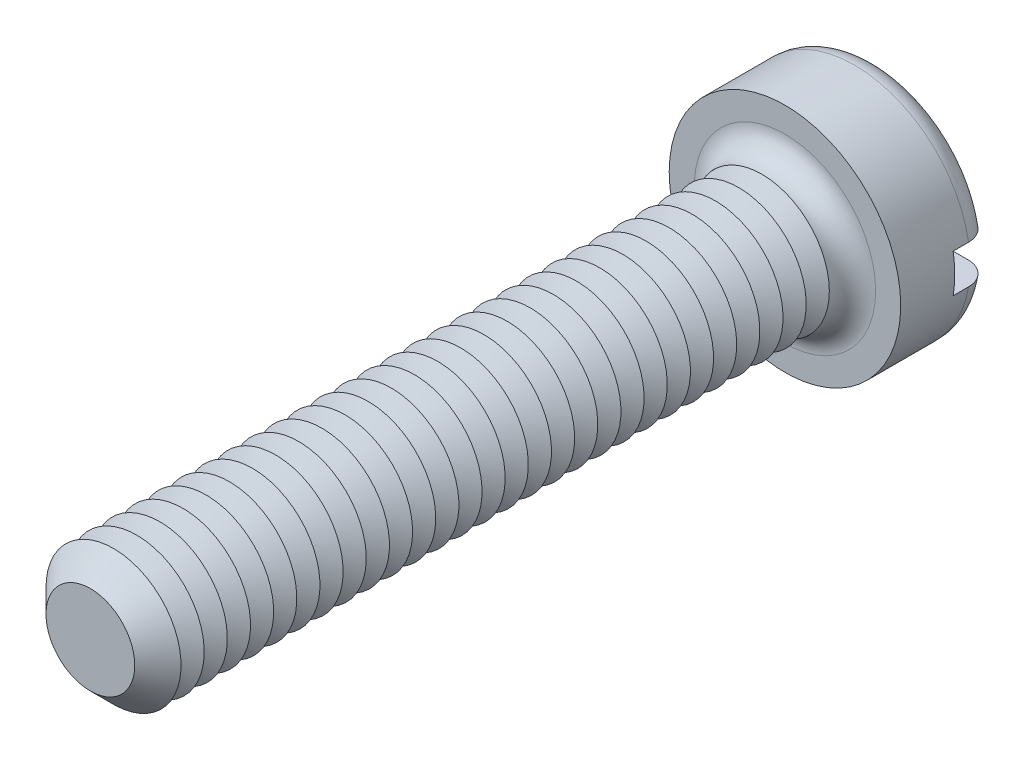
ISO-10303-21;
HEADER;
FILE_DESCRIPTION(('STEP AP214'),'2;1');
FILE_NAME('part.step','',(''),(''),'','','');
FILE_SCHEMA(('AUTOMOTIVE_DESIGN { 1 0 10303 214 1 1 1 1 }'));
ENDSEC;
DATA;
#1=APPLICATION_CONTEXT('core data for automotive mechanical design processes');
#2=APPLICATION_PROTOCOL_DEFINITION('international standard','automotive_design',2000,#1);
#3=PRODUCT_CONTEXT('',#1,'mechanical');
#4=PRODUCT('Part','Part','',(#3));
#5=PRODUCT_RELATED_PRODUCT_CATEGORY('part','',(#4));
#6=PRODUCT_DEFINITION_FORMATION('','',#4);
#7=PRODUCT_DEFINITION_CONTEXT('part definition',#1,'design');
#8=PRODUCT_DEFINITION('design','',#6,#7);
#9=PRODUCT_DEFINITION_SHAPE('','',#8);
#10=(LENGTH_UNIT() NAMED_UNIT(*) SI_UNIT(.MILLI.,.METRE.));
#11=(NAMED_UNIT(*) PLANE_ANGLE_UNIT() SI_UNIT($,.RADIAN.));
#12=(NAMED_UNIT(*) SI_UNIT($,.STERADIAN.) SOLID_ANGLE_UNIT());
#13=UNCERTAINTY_MEASURE_WITH_UNIT(LENGTH_MEASURE(1.E-05),#10,'distance_accuracy_value','');
#14=(GEOMETRIC_REPRESENTATION_CONTEXT(3) GLOBAL_UNCERTAINTY_ASSIGNED_CONTEXT((#13)) GLOBAL_UNIT_ASSIGNED_CONTEXT((#10,
#11,#12)) REPRESENTATION_CONTEXT('',''));
#15=CARTESIAN_POINT('',(0.,0.,0.));
#16=DIRECTION('',(0.,0.,1.));
#17=DIRECTION('',(1.,0.,0.));
#18=AXIS2_PLACEMENT_3D('',#15,#16,#17);
#19=CARTESIAN_POINT('',(0.,0.,-2.4));
#20=DIRECTION('',(0.,0.,1.));
#21=DIRECTION('',(1.,0.,0.));
#22=AXIS2_PLACEMENT_3D('',#19,#20,#21);
#23=PLANE('',#22);
#24=CARTESIAN_POINT('',(0.,0.,-2.4));
#25=DIRECTION('',(0.,0.,1.));
#26=DIRECTION('',(1.,0.,0.));
#27=AXIS2_PLACEMENT_3D('',#24,#25,#26);
#28=CIRCLE('',#27,2.4);
#29=CARTESIAN_POINT('',(-2.3473389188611,0.5,-2.4));
#30=VERTEX_POINT('',#29);
#31=CARTESIAN_POINT('',(2.3473389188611,0.5,-2.4));
#32=VERTEX_POINT('',#31);
#33=EDGE_CURVE('E116',#30,#32,#28,.F.);
#34=ORIENTED_EDGE('',*,*,#33,.T.);
#35=DIRECTION('',(1.,0.,0.));
#36=VECTOR('',#35,1.);
#37=CARTESIAN_POINT('',(-3.,0.5,-2.4));
#38=LINE('',#37,#36);
#39=EDGE_CURVE('E111',#30,#32,#38,.T.);
#40=ORIENTED_EDGE('',*,*,#39,.F.);
#41=EDGE_LOOP('',(#34,#40));
#42=FACE_BOUND('',#41,.T.);
#43=ADVANCED_FACE('F39',(#42),#23,.F.);
#44=CARTESIAN_POINT('',(0.,0.,-1.8));
#45=DIRECTION('',(0.,0.,1.));
#46=DIRECTION('',(1.,0.,0.));
#47=AXIS2_PLACEMENT_3D('',#44,#45,#46);
#48=TOROIDAL_SURFACE('',#47,2.4,0.6);
#49=CARTESIAN_POINT('',(-2.85761641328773,0.5,-2.13010535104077));
#50=CARTESIAN_POINT('',(-2.83871556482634,0.5,-2.1583605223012));
#51=CARTESIAN_POINT('',(-2.81738546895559,0.5,-2.18502342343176));
#52=CARTESIAN_POINT('',(-2.7705148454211,0.5,-2.23439244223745));
#53=CARTESIAN_POINT('',(-2.74496859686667,0.5,-2.25709309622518));
#54=CARTESIAN_POINT('',(-2.6904684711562,0.5,-2.29787524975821));
#55=CARTESIAN_POINT('',(-2.66151863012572,0.5,-2.3159621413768));
#56=CARTESIAN_POINT('',(-2.60103287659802,0.5,-2.34708203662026));
#57=CARTESIAN_POINT('',(-2.56949759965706,0.5,-2.36011627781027));
#58=CARTESIAN_POINT('',(-2.50430694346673,0.5,-2.38095952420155));
#59=CARTESIAN_POINT('',(-2.47062984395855,0.5,-2.38870056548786));
#60=CARTESIAN_POINT('',(-2.40245905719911,0.5,-2.39852415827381));
#61=CARTESIAN_POINT('',(-2.36796525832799,0.5,-2.40060593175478));
#62=CARTESIAN_POINT('',(-2.29850850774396,0.5,-2.39907718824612));
#63=CARTESIAN_POINT('',(-2.2635477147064,0.5,-2.3953679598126));
#64=CARTESIAN_POINT('',(-2.19472542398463,0.5,-2.38219781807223));
#65=CARTESIAN_POINT('',(-2.16086402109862,0.5,-2.37273641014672));
#66=CARTESIAN_POINT('',(-2.09483473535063,0.5,-2.3481926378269));
#67=CARTESIAN_POINT('',(-2.06268841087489,0.5,-2.3330521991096));
#68=CARTESIAN_POINT('',(-2.00140871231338,0.5,-2.29756210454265));
#69=CARTESIAN_POINT('',(-1.97227539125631,0.5,-2.27721235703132));
#70=CARTESIAN_POINT('',(-1.91805676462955,0.5,-2.23196210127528));
#71=CARTESIAN_POINT('',(-1.89294995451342,0.5,-2.20708739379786));
#72=CARTESIAN_POINT('',(-1.84740424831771,0.5,-2.1533758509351));
#73=CARTESIAN_POINT('',(-1.82696468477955,0.5,-2.12453958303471));
#74=CARTESIAN_POINT('',(-1.7919439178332,0.5,-2.06452274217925));
#75=CARTESIAN_POINT('',(-1.7772221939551,0.5,-2.03342424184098));
#76=CARTESIAN_POINT('',(-1.75343025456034,0.5,-1.96913621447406));
#77=CARTESIAN_POINT('',(-1.74435859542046,0.5,-1.93594722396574));
#78=CARTESIAN_POINT('',(-1.73243855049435,0.5,-1.86969199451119));
#79=CARTESIAN_POINT('',(-1.72938008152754,0.5,-1.83666346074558));
#80=CARTESIAN_POINT('',(-1.72896592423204,0.5,-1.77057287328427));
#81=CARTESIAN_POINT('',(-1.73160950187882,0.5,-1.73751082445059));
#82=CARTESIAN_POINT('',(-1.7423966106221,0.5,-1.67291835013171));
#83=CARTESIAN_POINT('',(-1.75043952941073,0.5,-1.64137102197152));
#84=CARTESIAN_POINT('',(-1.77163396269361,0.5,-1.58004446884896));
#85=CARTESIAN_POINT('',(-1.78478577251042,0.5,-1.55026534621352));
#86=CARTESIAN_POINT('',(-1.81598186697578,0.5,-1.49283859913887));
#87=CARTESIAN_POINT('',(-1.83409369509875,0.5,-1.46522772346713));
#88=CARTESIAN_POINT('',(-1.87455179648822,0.5,-1.41330756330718));
#89=CARTESIAN_POINT('',(-1.89689874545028,0.5,-1.38899880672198));
#90=CARTESIAN_POINT('',(-1.94600584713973,0.5,-1.34349499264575));
#91=CARTESIAN_POINT('',(-1.97289034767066,0.5,-1.32243411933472));
#92=CARTESIAN_POINT('',(-2.02972905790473,0.5,-1.28496935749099));
#93=CARTESIAN_POINT('',(-2.05968375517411,0.5,-1.26856621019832));
#94=CARTESIAN_POINT('',(-2.12276894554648,0.5,-1.24040709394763));
#95=CARTESIAN_POINT('',(-2.15596700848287,0.5,-1.22880230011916));
#96=CARTESIAN_POINT('',(-2.22383000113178,0.5,-1.21126311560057));
#97=CARTESIAN_POINT('',(-2.25849504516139,0.5,-1.20532916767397));
#98=CARTESIAN_POINT('',(-2.32870403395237,0.5,-1.1992792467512));
#99=CARTESIAN_POINT('',(-2.36425340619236,0.5,-1.19922586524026));
#100=CARTESIAN_POINT('',(-2.4348506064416,0.5,-1.2051326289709));
#101=CARTESIAN_POINT('',(-2.4698984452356,0.5,-1.21109264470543));
#102=CARTESIAN_POINT('',(-2.53821803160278,0.5,-1.22883658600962));
#103=CARTESIAN_POINT('',(-2.57150081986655,0.5,-1.24057794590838));
#104=CARTESIAN_POINT('',(-2.63557260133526,0.5,-1.2695744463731));
#105=CARTESIAN_POINT('',(-2.66636179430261,0.5,-1.28682914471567));
#106=CARTESIAN_POINT('',(-2.72402406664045,0.5,-1.32606063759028));
#107=CARTESIAN_POINT('',(-2.75095352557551,0.5,-1.34795455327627));
#108=CARTESIAN_POINT('',(-2.80067182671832,0.5,-1.39602603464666));
#109=CARTESIAN_POINT('',(-2.82346106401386,0.5,-1.42220319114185));
#110=CARTESIAN_POINT('',(-2.86383281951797,0.5,-1.47760238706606));
#111=CARTESIAN_POINT('',(-2.88149947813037,0.5,-1.50676312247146));
#112=CARTESIAN_POINT('',(-2.91160874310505,0.5,-1.56766595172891));
#113=CARTESIAN_POINT('',(-2.92405198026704,0.5,-1.59940773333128));
#114=CARTESIAN_POINT('',(-2.94319943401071,0.5,-1.66411282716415));
#115=CARTESIAN_POINT('',(-2.94997843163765,0.5,-1.69705402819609));
#116=CARTESIAN_POINT('',(-2.95787009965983,0.5,-1.7636173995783));
#117=CARTESIAN_POINT('',(-2.95898157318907,0.5,-1.79723971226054));
#118=CARTESIAN_POINT('',(-2.95551354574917,0.5,-1.86397776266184));
#119=CARTESIAN_POINT('',(-2.95096897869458,0.5,-1.89709534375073));
#120=CARTESIAN_POINT('',(-2.93638731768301,0.5,-1.96206785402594));
#121=CARTESIAN_POINT('',(-2.92635713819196,0.5,-1.99392431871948));
#122=CARTESIAN_POINT('',(-2.90618743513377,0.5,-2.04315073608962));
#123=CARTESIAN_POINT('',(-2.89769874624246,0.5,-2.06121519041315));
#124=CARTESIAN_POINT('',(-2.87895753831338,0.5,-2.096404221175));
#125=CARTESIAN_POINT('',(-2.86870503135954,0.5,-2.11352880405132));
#126=CARTESIAN_POINT('',(-2.85761641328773,0.5,-2.13010535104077));
#127=B_SPLINE_CURVE_WITH_KNOTS('',3,(#49,#50,#51,#52,#53,#54,#55,#56,#57,#58,#59,#60,#61,#62,
#63,#64,#65,#66,#67,#68,#69,#70,#71,#72,#73,#74,#75,#76,#77,#78,#79,#80,#81,#82,#83,#84,#85,#86,
#87,#88,#89,#90,#91,#92,#93,#94,#95,#96,#97,#98,#99,#100,#101,#102,#103,#104,#105,#106,#107,
#108,#109,#110,#111,#112,#113,#114,#115,#116,#117,#118,#119,#120,#121,#122,#123,#124,#125,#126),
.UNSPECIFIED.,.T.,.F.,(4,2,2,2,2,2,2,2,2,2,2,2,2,2,2,2,2,2,2,2,2,2,2,2,2,2,2,2,2,2,2,2,2,2,2,2,
2,2,4),(0.,0.101907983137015,0.203955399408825,0.305883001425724,0.407785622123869,
0.510973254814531,0.614175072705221,0.719155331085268,0.824144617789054,0.930238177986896,
1.03633360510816,1.14184204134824,1.24733537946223,1.35004136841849,1.45272110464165,
1.5517448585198,1.65075586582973,1.74797128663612,1.84519232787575,1.9438094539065,
2.0424423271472,2.14443321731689,2.24644032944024,2.35145317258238,2.45647421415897,
2.56261297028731,2.66874944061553,2.77411589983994,2.87947390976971,2.98308820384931,
3.08669260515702,3.18848388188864,3.29026286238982,3.39067588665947,3.49111011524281,
3.59092708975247,3.69061853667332,3.75040561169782,3.81019227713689),.UNSPECIFIED.);
#128=CARTESIAN_POINT('',(-2.95803989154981,0.5,-1.8));
#129=VERTEX_POINT('',#128);
#130=EDGE_CURVE('E403',#129,#30,#127,.T.);
#131=ORIENTED_EDGE('',*,*,#130,.F.);
#132=CARTESIAN_POINT('',(0.,0.,-1.8));
#133=DIRECTION('',(0.,0.,1.));
#134=DIRECTION('',(1.,0.,0.));
#135=AXIS2_PLACEMENT_3D('',#132,#133,#134);
#136=CIRCLE('',#135,3.);
#137=CARTESIAN_POINT('',(2.95803989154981,0.5,-1.8));
#138=VERTEX_POINT('',#137);
#139=EDGE_CURVE('E125',#138,#129,#136,.T.);
#140=ORIENTED_EDGE('',*,*,#139,.F.);
#141=CARTESIAN_POINT('',(1.78664846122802,0.5,-2.05158390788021));
#142=CARTESIAN_POINT('',(1.80142751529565,0.5,-2.08239430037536));
#143=CARTESIAN_POINT('',(1.81889355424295,0.5,-2.111949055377));
#144=CARTESIAN_POINT('',(1.8585933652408,0.5,-2.16770384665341));
#145=CARTESIAN_POINT('',(1.88083491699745,0.5,-2.19389829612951));
#146=CARTESIAN_POINT('',(1.92931942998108,0.5,-2.24217519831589));
#147=CARTESIAN_POINT('',(1.95555471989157,0.5,-2.26426535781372));
#148=CARTESIAN_POINT('',(2.01127789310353,0.5,-2.30384045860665));
#149=CARTESIAN_POINT('',(2.04076488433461,0.5,-2.32132665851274));
#150=CARTESIAN_POINT('',(2.10290022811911,0.5,-2.3516259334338));
#151=CARTESIAN_POINT('',(2.13560600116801,0.5,-2.3643213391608));
#152=CARTESIAN_POINT('',(2.20267136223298,0.5,-2.38412242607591));
#153=CARTESIAN_POINT('',(2.23703118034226,0.5,-2.3912273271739));
#154=CARTESIAN_POINT('',(2.30690186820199,0.5,-2.39969404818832));
#155=CARTESIAN_POINT('',(2.34242185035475,0.5,-2.40098100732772));
#156=CARTESIAN_POINT('',(2.41317063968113,0.5,-2.39753827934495));
#157=CARTESIAN_POINT('',(2.44839945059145,0.5,-2.39280866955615));
#158=CARTESIAN_POINT('',(2.51734146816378,0.5,-2.37746773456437));
#159=CARTESIAN_POINT('',(2.55106223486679,0.5,-2.3668904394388));
#160=CARTESIAN_POINT('',(2.61620389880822,0.5,-2.34013333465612));
#161=CARTESIAN_POINT('',(2.64762498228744,0.5,-2.32395397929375));
#162=CARTESIAN_POINT('',(2.70673284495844,0.5,-2.28672393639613));
#163=CARTESIAN_POINT('',(2.73447138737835,0.5,-2.26575544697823));
#164=CARTESIAN_POINT('',(2.78595339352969,0.5,-2.21938197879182));
#165=CARTESIAN_POINT('',(2.80969724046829,0.5,-2.19397742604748));
#166=CARTESIAN_POINT('',(2.85207235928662,0.5,-2.13993965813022));
#167=CARTESIAN_POINT('',(2.87078674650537,0.5,-2.11137160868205));
#168=CARTESIAN_POINT('',(2.90307455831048,0.5,-2.05146448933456));
#169=CARTESIAN_POINT('',(2.91664841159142,0.5,-2.02012565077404));
#170=CARTESIAN_POINT('',(2.93808283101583,0.5,-1.95603682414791));
#171=CARTESIAN_POINT('',(2.94602016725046,0.5,-1.92331249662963));
#172=CARTESIAN_POINT('',(2.95624273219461,0.5,-1.85699296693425));
#173=CARTESIAN_POINT('',(2.95852824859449,0.5,-1.82339780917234));
#174=CARTESIAN_POINT('',(2.95738171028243,0.5,-1.75655451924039));
#175=CARTESIAN_POINT('',(2.95399174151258,0.5,-1.72330565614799));
#176=CARTESIAN_POINT('',(2.94167749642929,0.5,-1.65784996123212));
#177=CARTESIAN_POINT('',(2.93275329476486,0.5,-1.62564311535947));
#178=CARTESIAN_POINT('',(2.90963870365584,0.5,-1.56317641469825));
#179=CARTESIAN_POINT('',(2.89544787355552,0.5,-1.53291672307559));
#180=CARTESIAN_POINT('',(2.86222325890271,0.5,-1.47518589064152));
#181=CARTESIAN_POINT('',(2.84318935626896,0.5,-1.44771481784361));
#182=CARTESIAN_POINT('',(2.80067851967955,0.5,-1.39611362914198));
#183=CARTESIAN_POINT('',(2.77716960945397,0.5,-1.37200986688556));
#184=CARTESIAN_POINT('',(2.72648704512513,0.5,-1.3280274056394));
#185=CARTESIAN_POINT('',(2.69931317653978,0.5,-1.3081489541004));
#186=CARTESIAN_POINT('',(2.64167967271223,0.5,-1.27288334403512));
#187=CARTESIAN_POINT('',(2.61118015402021,0.5,-1.25756138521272));
#188=CARTESIAN_POINT('',(2.54807315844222,0.5,-1.2321564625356));
#189=CARTESIAN_POINT('',(2.51546550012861,0.5,-1.22207395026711));
#190=CARTESIAN_POINT('',(2.44846246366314,0.5,-1.20724783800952));
#191=CARTESIAN_POINT('',(2.41404584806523,0.5,-1.2026002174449));
#192=CARTESIAN_POINT('',(2.34491756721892,0.5,-1.19904907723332));
#193=CARTESIAN_POINT('',(2.3102058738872,0.5,-1.20014611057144));
#194=CARTESIAN_POINT('',(2.24087507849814,0.5,-1.20808958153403));
#195=CARTESIAN_POINT('',(2.20626660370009,0.5,-1.21502895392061));
#196=CARTESIAN_POINT('',(2.13868705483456,0.5,-1.23457616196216));
#197=CARTESIAN_POINT('',(2.10571611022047,0.5,-1.24718444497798));
#198=CARTESIAN_POINT('',(2.04212010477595,0.5,-1.2778419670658));
#199=CARTESIAN_POINT('',(2.0115131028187,0.5,-1.29592871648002));
#200=CARTESIAN_POINT('',(1.95381117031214,0.5,-1.33703838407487));
#201=CARTESIAN_POINT('',(1.92671618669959,0.5,-1.36006122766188));
#202=CARTESIAN_POINT('',(1.8771749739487,0.5,-1.41014760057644));
#203=CARTESIAN_POINT('',(1.85467966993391,0.5,-1.43716252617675));
#204=CARTESIAN_POINT('',(1.8147167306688,0.5,-1.49468601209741));
#205=CARTESIAN_POINT('',(1.79724791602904,0.5,-1.52519375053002));
#206=CARTESIAN_POINT('',(1.76843420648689,0.5,-1.58782676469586));
#207=CARTESIAN_POINT('',(1.75691546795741,0.5,-1.61987202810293));
#208=CARTESIAN_POINT('',(1.73963101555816,0.5,-1.68548715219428));
#209=CARTESIAN_POINT('',(1.73386545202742,0.5,-1.71905705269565));
#210=CARTESIAN_POINT('',(1.72840927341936,0.5,-1.78556262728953));
#211=CARTESIAN_POINT('',(1.72852416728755,0.5,-1.8184825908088));
#212=CARTESIAN_POINT('',(1.73434422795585,0.5,-1.88379362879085));
#213=CARTESIAN_POINT('',(1.74004181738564,0.5,-1.91618535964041));
#214=CARTESIAN_POINT('',(1.75312909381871,0.5,-1.96568884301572));
#215=CARTESIAN_POINT('',(1.75869685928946,0.5,-1.98330302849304));
#216=CARTESIAN_POINT('',(1.77146455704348,0.5,-2.01792824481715));
#217=CARTESIAN_POINT('',(1.7786644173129,0.5,-2.03493930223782));
#218=CARTESIAN_POINT('',(1.78664846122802,0.5,-2.05158390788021));
#219=B_SPLINE_CURVE_WITH_KNOTS('',3,(#141,#142,#143,#144,#145,#146,#147,#148,#149,#150,#151,
#152,#153,#154,#155,#156,#157,#158,#159,#160,#161,#162,#163,#164,#165,#166,#167,#168,#169,#170,
#171,#172,#173,#174,#175,#176,#177,#178,#179,#180,#181,#182,#183,#184,#185,#186,#187,#188,#189,
#190,#191,#192,#193,#194,#195,#196,#197,#198,#199,#200,#201,#202,#203,#204,#205,#206,#207,#208,
#209,#210,#211,#212,#213,#214,#215,#216,#217,#218),.UNSPECIFIED.,.T.,.F.,(4,2,2,2,2,2,2,2,2,2,2,
2,2,2,2,2,2,2,2,2,2,2,2,2,2,2,2,2,2,2,2,2,2,2,2,2,2,2,4),(0.,0.10244464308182,0.205057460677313,
0.307475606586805,0.409865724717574,0.514628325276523,0.619405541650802,0.72552718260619,
0.831647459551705,0.937156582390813,1.04265715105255,1.1464674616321,1.25026780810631,
1.3522293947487,1.45418247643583,1.55471883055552,1.6552500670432,1.75503912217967,
1.8548268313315,1.95462289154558,2.05442138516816,2.15496174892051,2.25550799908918,
2.35743049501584,2.45936177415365,2.56306719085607,2.66678259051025,2.77217967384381,
2.87758507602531,2.98372914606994,3.08987161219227,3.19481457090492,3.29973288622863,
3.40138228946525,3.50303434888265,3.60132659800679,3.69948562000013,3.75483142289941,
3.8101747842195),.UNSPECIFIED.);
#220=EDGE_CURVE('E405',#32,#138,#219,.T.);
#221=ORIENTED_EDGE('',*,*,#220,.F.);
#222=ORIENTED_EDGE('',*,*,#33,.F.);
#223=EDGE_LOOP('',(#131,#140,#221,#222));
#224=FACE_BOUND('',#223,.T.);
#225=ADVANCED_FACE('F387',(#224),#48,.T.);
#226=CARTESIAN_POINT('',(0.,0.,-2.4));
#227=DIRECTION('',(0.,0.,1.));
#228=DIRECTION('',(1.,0.,0.));
#229=AXIS2_PLACEMENT_3D('',#226,#227,#228);
#230=CYLINDRICAL_SURFACE('',#229,3.);
#231=DIRECTION('',(0.,0.,1.));
#232=VECTOR('',#231,1.);
#233=CARTESIAN_POINT('',(2.95803989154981,0.5,-2.4));
#234=LINE('',#233,#232);
#235=CARTESIAN_POINT('',(2.95803989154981,0.5,-1.4));
#236=VERTEX_POINT('',#235);
#237=EDGE_CURVE('E419',#138,#236,#234,.T.);
#238=ORIENTED_EDGE('',*,*,#237,.F.);
#239=ORIENTED_EDGE('',*,*,#139,.T.);
#240=DIRECTION('',(0.,0.,1.));
#241=VECTOR('',#240,1.);
#242=CARTESIAN_POINT('',(-2.95803989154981,0.5,-2.4));
#243=LINE('',#242,#241);
#244=CARTESIAN_POINT('',(-2.95803989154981,0.5,-1.4));
#245=VERTEX_POINT('',#244);
#246=EDGE_CURVE('E63',#245,#129,#243,.F.);
#247=ORIENTED_EDGE('',*,*,#246,.F.);
#248=CARTESIAN_POINT('',(0.,0.,-1.4));
#249=DIRECTION('',(0.,0.,-1.));
#250=DIRECTION('',(-1.,0.,0.));
#251=AXIS2_PLACEMENT_3D('',#248,#249,#250);
#252=CIRCLE('',#251,3.);
#253=CARTESIAN_POINT('',(-2.95803989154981,-0.5,-1.4));
#254=VERTEX_POINT('',#253);
#255=EDGE_CURVE('E43',#245,#254,#252,.F.);
#256=ORIENTED_EDGE('',*,*,#255,.T.);
#257=DIRECTION('',(0.,0.,1.));
#258=VECTOR('',#257,1.);
#259=CARTESIAN_POINT('',(-2.95803989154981,-0.5,-2.4));
#260=LINE('',#259,#258);
#261=CARTESIAN_POINT('',(-2.9580398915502,-0.5,-1.79999999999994));
#262=VERTEX_POINT('',#261);
#263=EDGE_CURVE('E416',#262,#254,#260,.T.);
#264=ORIENTED_EDGE('',*,*,#263,.F.);
#265=CARTESIAN_POINT('',(2.95803989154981,-0.5,-1.8));
#266=VERTEX_POINT('',#265);
#267=EDGE_CURVE('E127',#262,#266,#136,.T.);
#268=ORIENTED_EDGE('',*,*,#267,.T.);
#269=DIRECTION('',(0.,0.,1.));
#270=VECTOR('',#269,1.);
#271=CARTESIAN_POINT('',(2.95803989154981,-0.5,-2.4));
#272=LINE('',#271,#270);
#273=CARTESIAN_POINT('',(2.95803989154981,-0.5,-1.4));
#274=VERTEX_POINT('',#273);
#275=EDGE_CURVE('E55',#274,#266,#272,.F.);
#276=ORIENTED_EDGE('',*,*,#275,.F.);
#277=EDGE_CURVE('E11',#274,#236,#252,.F.);
#278=ORIENTED_EDGE('',*,*,#277,.T.);
#279=EDGE_LOOP('',(#238,#239,#247,#256,#264,#268,#276,#278));
#280=FACE_BOUND('',#279,.T.);
#281=CARTESIAN_POINT('',(0.,0.,0.));
#282=DIRECTION('',(0.,0.,1.));
#283=DIRECTION('',(1.,0.,0.));
#284=AXIS2_PLACEMENT_3D('',#281,#282,#283);
#285=CIRCLE('',#284,3.);
#286=CARTESIAN_POINT('',(3.,0.,0.));
#287=VERTEX_POINT('',#286);
#288=EDGE_CURVE('E422',#287,#287,#285,.T.);
#289=ORIENTED_EDGE('',*,*,#288,.F.);
#290=EDGE_LOOP('',(#289));
#291=FACE_BOUND('',#290,.T.);
#292=ADVANCED_FACE('F383',(#280,#291),#230,.T.);
#293=CARTESIAN_POINT('',(2.3473389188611,-0.5,-2.4));
#294=VERTEX_POINT('',#293);
#295=CARTESIAN_POINT('',(-2.3473389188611,-0.5,-2.4));
#296=VERTEX_POINT('',#295);
#297=EDGE_CURVE('E109',#294,#296,#28,.F.);
#298=ORIENTED_EDGE('',*,*,#297,.T.);
#299=DIRECTION('',(-1.,0.,0.));
#300=VECTOR('',#299,1.);
#301=CARTESIAN_POINT('',(-3.,-0.5,-2.4));
#302=LINE('',#301,#300);
#303=EDGE_CURVE('E96',#294,#296,#302,.T.);
#304=ORIENTED_EDGE('',*,*,#303,.F.);
#305=EDGE_LOOP('',(#298,#304));
#306=FACE_BOUND('',#305,.T.);
#307=ADVANCED_FACE('F108',(#306),#23,.F.);
#308=CARTESIAN_POINT('',(0.,0.,0.));
#309=DIRECTION('',(0.,0.,1.));
#310=DIRECTION('',(1.,0.,0.));
#311=AXIS2_PLACEMENT_3D('',#308,#309,#310);
#312=PLANE('',#311);
#313=CARTESIAN_POINT('',(0.,0.,0.));
#314=DIRECTION('',(0.,0.,1.));
#315=DIRECTION('',(1.,0.,0.));
#316=AXIS2_PLACEMENT_3D('',#313,#314,#315);
#317=CIRCLE('',#316,2.35);
#318=CARTESIAN_POINT('',(2.35,0.,0.));
#319=VERTEX_POINT('',#318);
#320=EDGE_CURVE('E115',#319,#319,#317,.F.);
#321=ORIENTED_EDGE('',*,*,#320,.T.);
#322=EDGE_LOOP('',(#321));
#323=FACE_BOUND('',#322,.T.);
#324=ORIENTED_EDGE('',*,*,#288,.T.);
#325=EDGE_LOOP('',(#324));
#326=FACE_BOUND('',#325,.T.);
#327=ADVANCED_FACE('F382',(#323,#326),#312,.T.);
#328=CARTESIAN_POINT('',(-2.85761641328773,-0.5,-2.13010535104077));
#329=CARTESIAN_POINT('',(-2.87617085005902,-0.5,-2.10236255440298));
#330=CARTESIAN_POINT('',(-2.89241094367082,-0.5,-2.07304478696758));
#331=CARTESIAN_POINT('',(-2.91975805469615,-0.5,-2.01207835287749));
#332=CARTESIAN_POINT('',(-2.93085958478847,-0.5,-1.98042723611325));
#333=CARTESIAN_POINT('',(-2.94757590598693,-0.5,-1.91570997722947));
#334=CARTESIAN_POINT('',(-2.95319165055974,-0.5,-1.88264408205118));
#335=CARTESIAN_POINT('',(-2.95876526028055,-0.5,-1.81604673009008));
#336=CARTESIAN_POINT('',(-2.95872441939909,-0.5,-1.78251538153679));
#337=CARTESIAN_POINT('',(-2.95300126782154,-0.5,-1.71606888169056));
#338=CARTESIAN_POINT('',(-2.94734076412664,-0.5,-1.68315184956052));
#339=CARTESIAN_POINT('',(-2.93058183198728,-0.5,-1.61873244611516));
#340=CARTESIAN_POINT('',(-2.91948325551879,-0.5,-1.58723011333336));
#341=CARTESIAN_POINT('',(-2.89215903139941,-0.5,-1.52647404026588));
#342=CARTESIAN_POINT('',(-2.87592518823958,-0.5,-1.49722398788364));
#343=CARTESIAN_POINT('',(-2.83881787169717,-0.5,-1.44183365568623));
#344=CARTESIAN_POINT('',(-2.81794425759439,-0.5,-1.41569347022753));
#345=CARTESIAN_POINT('',(-2.77196258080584,-0.5,-1.36700890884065));
#346=CARTESIAN_POINT('',(-2.74681874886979,-0.5,-1.34449832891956));
#347=CARTESIAN_POINT('',(-2.69315595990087,-0.5,-1.30394571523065));
#348=CARTESIAN_POINT('',(-2.66463678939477,-0.5,-1.28590396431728));
#349=CARTESIAN_POINT('',(-2.6045885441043,-0.5,-1.25451133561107));
#350=CARTESIAN_POINT('',(-2.573021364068,-0.5,-1.24123336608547));
#351=CARTESIAN_POINT('',(-2.50813094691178,-0.5,-1.22006271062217));
#352=CARTESIAN_POINT('',(-2.47480755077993,-0.5,-1.21217051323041));
#353=CARTESIAN_POINT('',(-2.40672281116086,-0.5,-1.20185046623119));
#354=CARTESIAN_POINT('',(-2.37194646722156,-0.5,-1.19952155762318));
#355=CARTESIAN_POINT('',(-2.30248663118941,-0.5,-1.20064178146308));
#356=CARTESIAN_POINT('',(-2.26780314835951,-0.5,-1.20409147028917));
#357=CARTESIAN_POINT('',(-2.19896003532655,-0.5,-1.21674803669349));
#358=CARTESIAN_POINT('',(-2.16481620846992,-0.5,-1.22604100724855));
#359=CARTESIAN_POINT('',(-2.09855902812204,-0.5,-1.25020237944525));
#360=CARTESIAN_POINT('',(-2.0664458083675,-0.5,-1.2650711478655));
#361=CARTESIAN_POINT('',(-2.00504979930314,-0.5,-1.3000633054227));
#362=CARTESIAN_POINT('',(-1.97577870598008,-0.5,-1.32020724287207));
#363=CARTESIAN_POINT('',(-1.92109882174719,-0.5,-1.36519538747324));
#364=CARTESIAN_POINT('',(-1.89568984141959,-0.5,-1.39003936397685));
#365=CARTESIAN_POINT('',(-1.84992350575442,-0.5,-1.44333696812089));
#366=CARTESIAN_POINT('',(-1.82949305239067,-0.5,-1.47172774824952));
#367=CARTESIAN_POINT('',(-1.79388305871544,-0.5,-1.53163225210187));
#368=CARTESIAN_POINT('',(-1.77870235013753,-0.5,-1.56314527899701));
#369=CARTESIAN_POINT('',(-1.7545759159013,-0.5,-1.62726698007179));
#370=CARTESIAN_POINT('',(-1.74543784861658,-0.5,-1.65980327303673));
#371=CARTESIAN_POINT('',(-1.73294830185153,-0.5,-1.72596654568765));
#372=CARTESIAN_POINT('',(-1.72959555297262,-0.5,-1.7595932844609));
#373=CARTESIAN_POINT('',(-1.72881879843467,-0.5,-1.82588200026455));
#374=CARTESIAN_POINT('',(-1.73121660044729,-0.5,-1.85854202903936));
#375=CARTESIAN_POINT('',(-1.74148022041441,-0.5,-1.9229888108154));
#376=CARTESIAN_POINT('',(-1.74934586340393,-0.5,-1.95477559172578));
#377=CARTESIAN_POINT('',(-1.77023164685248,-0.5,-2.01650910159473));
#378=CARTESIAN_POINT('',(-1.78323812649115,-0.5,-2.04646046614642));
#379=CARTESIAN_POINT('',(-1.81396733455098,-0.5,-2.10383471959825));
#380=CARTESIAN_POINT('',(-1.83169061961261,-0.5,-2.13125730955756));
#381=CARTESIAN_POINT('',(-1.87183626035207,-0.5,-2.18359240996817));
#382=CARTESIAN_POINT('',(-1.89437158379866,-0.5,-2.20841820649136));
#383=CARTESIAN_POINT('',(-1.9431646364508,-0.5,-2.25409214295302));
#384=CARTESIAN_POINT('',(-1.96942301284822,-0.5,-2.27493958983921));
#385=CARTESIAN_POINT('',(-2.025898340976,-0.5,-2.31281042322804));
#386=CARTESIAN_POINT('',(-2.05622082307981,-0.5,-2.32967654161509));
#387=CARTESIAN_POINT('',(-2.11922391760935,-0.5,-2.35820255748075));
#388=CARTESIAN_POINT('',(-2.15190483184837,-0.5,-2.3698617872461));
#389=CARTESIAN_POINT('',(-2.21944675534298,-0.5,-2.38785911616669));
#390=CARTESIAN_POINT('',(-2.25433929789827,-0.5,-2.39407914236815));
#391=CARTESIAN_POINT('',(-2.32467357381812,-0.5,-2.40058243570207));
#392=CARTESIAN_POINT('',(-2.36011530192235,-0.5,-2.40086575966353));
#393=CARTESIAN_POINT('',(-2.43058129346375,-0.5,-2.39545061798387));
#394=CARTESIAN_POINT('',(-2.46560504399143,-0.5,-2.38974544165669));
#395=CARTESIAN_POINT('',(-2.53418188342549,-0.5,-2.37245602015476));
#396=CARTESIAN_POINT('',(-2.56773468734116,-0.5,-2.36087064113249));
#397=CARTESIAN_POINT('',(-2.63195003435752,-0.5,-2.33229154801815));
#398=CARTESIAN_POINT('',(-2.66264330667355,-0.5,-2.31536681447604));
#399=CARTESIAN_POINT('',(-2.72065333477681,-0.5,-2.2765252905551));
#400=CARTESIAN_POINT('',(-2.7479744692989,-0.5,-2.25461508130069));
#401=CARTESIAN_POINT('',(-2.78903570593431,-0.5,-2.21539504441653));
#402=CARTESIAN_POINT('',(-2.80405150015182,-0.5,-2.19939833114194));
#403=CARTESIAN_POINT('',(-2.83224965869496,-0.5,-2.16586257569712));
#404=CARTESIAN_POINT('',(-2.84543204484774,-0.5,-2.14832355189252));
#405=CARTESIAN_POINT('',(-2.85761641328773,-0.5,-2.13010535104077));
#406=B_SPLINE_CURVE_WITH_KNOTS('',3,(#328,#329,#330,#331,#332,#333,#334,#335,#336,#337,#338,
#339,#340,#341,#342,#343,#344,#345,#346,#347,#348,#349,#350,#351,#352,#353,#354,#355,#356,#357,
#358,#359,#360,#361,#362,#363,#364,#365,#366,#367,#368,#369,#370,#371,#372,#373,#374,#375,#376,
#377,#378,#379,#380,#381,#382,#383,#384,#385,#386,#387,#388,#389,#390,#391,#392,#393,#394,#395,
#396,#397,#398,#399,#400,#401,#402,#403,#404,#405),.UNSPECIFIED.,.T.,.F.,(4,2,2,2,2,2,2,2,2,2,2,
2,2,2,2,2,2,2,2,2,2,2,2,2,2,2,2,2,2,2,2,2,2,2,2,2,2,2,4),(0.,0.100047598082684,
0.200201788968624,0.300338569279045,0.400452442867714,0.500179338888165,0.599908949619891,
0.699798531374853,0.799691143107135,0.900465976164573,1.00124718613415,1.10351091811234,
1.20578392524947,1.30986270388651,1.41395150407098,1.51961105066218,1.62527754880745,
1.73136193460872,1.83744111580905,1.94185359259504,2.04624281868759,2.1471248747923,
2.24798479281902,2.34575994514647,2.44353196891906,2.541045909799,2.63857136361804,
2.73870431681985,2.83885469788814,2.94247024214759,3.0460990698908,3.15192527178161,
3.25775046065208,3.36369436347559,3.46965870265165,3.57430655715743,3.67881706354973,
3.74451732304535,3.81021680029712),.UNSPECIFIED.);
#407=EDGE_CURVE('E103',#296,#262,#406,.T.);
#408=ORIENTED_EDGE('',*,*,#407,.F.);
#409=ORIENTED_EDGE('',*,*,#297,.F.);
#410=CARTESIAN_POINT('',(1.78664846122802,-0.5,-2.05158390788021));
#411=CARTESIAN_POINT('',(1.77253256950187,-0.5,-2.02214917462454));
#412=CARTESIAN_POINT('',(1.76084795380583,-0.5,-1.99152692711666));
#413=CARTESIAN_POINT('',(1.74276267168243,-0.5,-1.92873811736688));
#414=CARTESIAN_POINT('',(1.73636622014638,-0.5,-1.89657034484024));
#415=CARTESIAN_POINT('',(1.72910271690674,-0.5,-1.83160458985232));
#416=CARTESIAN_POINT('',(1.72823699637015,-0.5,-1.79880645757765));
#417=CARTESIAN_POINT('',(1.73207277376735,-0.5,-1.73354460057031));
#418=CARTESIAN_POINT('',(1.7367732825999,-0.5,-1.70108081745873));
#419=CARTESIAN_POINT('',(1.75151033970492,-0.5,-1.63763571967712));
#420=CARTESIAN_POINT('',(1.76150868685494,-0.5,-1.60664550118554));
#421=CARTESIAN_POINT('',(1.78646773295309,-0.5,-1.54673433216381));
#422=CARTESIAN_POINT('',(1.80142897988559,-0.5,-1.51781361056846));
#423=CARTESIAN_POINT('',(1.8361687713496,-0.5,-1.46223275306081));
#424=CARTESIAN_POINT('',(1.85603637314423,-0.5,-1.43562834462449));
#425=CARTESIAN_POINT('',(1.89981598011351,-0.5,-1.38598822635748));
#426=CARTESIAN_POINT('',(1.92372865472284,-0.5,-1.3629531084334));
#427=CARTESIAN_POINT('',(1.97581791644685,-0.5,-1.32025912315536));
#428=CARTESIAN_POINT('',(2.00411431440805,-0.5,-1.30074638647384));
#429=CARTESIAN_POINT('',(2.06351340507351,-0.5,-1.26660223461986));
#430=CARTESIAN_POINT('',(2.09461651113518,-0.5,-1.2519715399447));
#431=CARTESIAN_POINT('',(2.15964055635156,-0.5,-1.22763649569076));
#432=CARTESIAN_POINT('',(2.19361437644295,-0.5,-1.21807321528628));
#433=CARTESIAN_POINT('',(2.26268197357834,-0.5,-1.20474094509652));
#434=CARTESIAN_POINT('',(2.29777581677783,-0.5,-1.20097229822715));
#435=CARTESIAN_POINT('',(2.36834397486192,-0.5,-1.19935270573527));
#436=CARTESIAN_POINT('',(2.40381924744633,-0.5,-1.20154258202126));
#437=CARTESIAN_POINT('',(2.47388621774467,-0.5,-1.211906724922));
#438=CARTESIAN_POINT('',(2.50847794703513,-0.5,-1.22008077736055));
#439=CARTESIAN_POINT('',(2.57542869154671,-0.5,-1.24211740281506));
#440=CARTESIAN_POINT('',(2.60780612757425,-0.5,-1.25592395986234));
#441=CARTESIAN_POINT('',(2.66972487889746,-0.5,-1.28886991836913));
#442=CARTESIAN_POINT('',(2.69926644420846,-0.5,-1.3080088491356));
#443=CARTESIAN_POINT('',(2.75412764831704,-0.5,-1.35072337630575));
#444=CARTESIAN_POINT('',(2.77951140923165,-0.5,-1.37421661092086));
#445=CARTESIAN_POINT('',(2.82588981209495,-0.5,-1.42519687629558));
#446=CARTESIAN_POINT('',(2.84688487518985,-0.5,-1.4526835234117));
#447=CARTESIAN_POINT('',(2.88351678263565,-0.5,-1.51036368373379));
#448=CARTESIAN_POINT('',(2.89923879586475,-0.5,-1.54050312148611));
#449=CARTESIAN_POINT('',(2.92532780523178,-0.5,-1.60301687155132));
#450=CARTESIAN_POINT('',(2.93569520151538,-0.5,-1.63539101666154));
#451=CARTESIAN_POINT('',(2.95066155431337,-0.5,-1.70102985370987));
#452=CARTESIAN_POINT('',(2.95532930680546,-0.5,-1.73427887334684));
#453=CARTESIAN_POINT('',(2.9589838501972,-0.5,-1.80108716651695));
#454=CARTESIAN_POINT('',(2.95797087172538,-0.5,-1.83464642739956));
#455=CARTESIAN_POINT('',(2.9503157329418,-0.5,-1.90093629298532));
#456=CARTESIAN_POINT('',(2.9437032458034,-0.5,-1.93367033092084));
#457=CARTESIAN_POINT('',(2.92508830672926,-0.5,-1.99756717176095));
#458=CARTESIAN_POINT('',(2.91308586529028,-0.5,-2.02872997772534));
#459=CARTESIAN_POINT('',(2.88401713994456,-0.5,-2.08868263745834));
#460=CARTESIAN_POINT('',(2.86693946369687,-0.5,-2.11746696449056));
#461=CARTESIAN_POINT('',(2.82823635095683,-0.5,-2.17179415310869));
#462=CARTESIAN_POINT('',(2.80661076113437,-0.5,-2.19733690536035));
#463=CARTESIAN_POINT('',(2.75921750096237,-0.5,-2.24472182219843));
#464=CARTESIAN_POINT('',(2.73341278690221,-0.5,-2.26652692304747));
#465=CARTESIAN_POINT('',(2.67855512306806,-0.5,-2.30557116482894));
#466=CARTESIAN_POINT('',(2.64950194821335,-0.5,-2.32280998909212));
#467=CARTESIAN_POINT('',(2.58850670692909,-0.5,-2.35251615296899));
#468=CARTESIAN_POINT('',(2.55652763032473,-0.5,-2.36490748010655));
#469=CARTESIAN_POINT('',(2.4909651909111,-0.5,-2.38424946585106));
#470=CARTESIAN_POINT('',(2.45738167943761,-0.5,-2.39119961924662));
#471=CARTESIAN_POINT('',(2.38892891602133,-0.5,-2.39958830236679));
#472=CARTESIAN_POINT('',(2.35404742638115,-0.5,-2.40092701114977));
#473=CARTESIAN_POINT('',(2.28454389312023,-0.5,-2.39781917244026));
#474=CARTESIAN_POINT('',(2.24992186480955,-0.5,-2.39337228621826));
#475=CARTESIAN_POINT('',(2.18139250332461,-0.5,-2.37872879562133));
#476=CARTESIAN_POINT('',(2.14750264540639,-0.5,-2.36845030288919));
#477=CARTESIAN_POINT('',(2.08190943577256,-0.5,-2.34236291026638));
#478=CARTESIAN_POINT('',(2.05020675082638,-0.5,-2.32655233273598));
#479=CARTESIAN_POINT('',(1.98982495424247,-0.5,-2.28976285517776));
#480=CARTESIAN_POINT('',(1.96115527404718,-0.5,-2.26876847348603));
#481=CARTESIAN_POINT('',(1.90785147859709,-0.5,-2.22220002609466));
#482=CARTESIAN_POINT('',(1.88321231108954,-0.5,-2.19663177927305));
#483=CARTESIAN_POINT('',(1.84638483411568,-0.5,-2.15106161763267));
#484=CARTESIAN_POINT('',(1.8328227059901,-0.5,-2.13215328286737));
#485=CARTESIAN_POINT('',(1.80797918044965,-0.5,-2.09289185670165));
#486=CARTESIAN_POINT('',(1.79669771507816,-0.5,-2.07253880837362));
#487=CARTESIAN_POINT('',(1.78664846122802,-0.5,-2.05158390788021));
#488=B_SPLINE_CURVE_WITH_KNOTS('',3,(#410,#411,#412,#413,#414,#415,#416,#417,#418,#419,#420,
#421,#422,#423,#424,#425,#426,#427,#428,#429,#430,#431,#432,#433,#434,#435,#436,#437,#438,#439,
#440,#441,#442,#443,#444,#445,#446,#447,#448,#449,#450,#451,#452,#453,#454,#455,#456,#457,#458,
#459,#460,#461,#462,#463,#464,#465,#466,#467,#468,#469,#470,#471,#472,#473,#474,#475,#476,#477,
#478,#479,#480,#481,#482,#483,#484,#485,#486,#487),.UNSPECIFIED.,.T.,.F.,(4,2,2,2,2,2,2,2,2,2,2,
2,2,2,2,2,2,2,2,2,2,2,2,2,2,2,2,2,2,2,2,2,2,2,2,2,2,2,4),(0.,0.0978512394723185,0.19578039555,
0.293733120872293,0.391668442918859,0.488907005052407,0.58615630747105,0.685320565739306,
0.784501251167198,0.887148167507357,0.989810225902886,1.09519726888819,1.20059054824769,
1.30670769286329,1.41282103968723,1.51790384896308,1.62297738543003,1.72623563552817,
1.82948397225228,1.93097382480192,2.03245609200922,2.13270093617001,2.23294171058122,
2.33265458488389,2.43236726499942,2.53230548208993,2.63224706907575,2.73312861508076,
2.83401715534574,2.93642973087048,3.03885181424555,3.14308833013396,3.24733094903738,
3.35307493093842,3.45885100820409,3.56494689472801,3.67090875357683,3.74057217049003,
3.81023351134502),.UNSPECIFIED.);
#489=EDGE_CURVE('E92',#266,#294,#488,.T.);
#490=ORIENTED_EDGE('',*,*,#489,.F.);
#491=ORIENTED_EDGE('',*,*,#267,.F.);
#492=EDGE_LOOP('',(#408,#409,#490,#491));
#493=FACE_BOUND('',#492,.T.);
#494=ADVANCED_FACE('F113',(#493),#48,.T.);
#495=CARTESIAN_POINT('',(0.,0.,0.6));
#496=DIRECTION('',(0.,0.,1.));
#497=DIRECTION('',(1.,0.,0.));
#498=AXIS2_PLACEMENT_3D('',#495,#496,#497);
#499=TOROIDAL_SURFACE('',#498,2.35,0.6);
#500=ORIENTED_EDGE('',*,*,#320,.F.);
#501=EDGE_LOOP('',(#500));
#502=FACE_BOUND('',#501,.T.);
#503=CARTESIAN_POINT('',(0.,0.,0.6));
#504=DIRECTION('',(0.,0.,-1.));
#505=DIRECTION('',(-1.,0.,0.));
#506=AXIS2_PLACEMENT_3D('',#503,#504,#505);
#507=CIRCLE('',#506,1.75);
#508=CARTESIAN_POINT('',(-1.75,0.,0.6));
#509=VERTEX_POINT('',#508);
#510=EDGE_CURVE('E427',#509,#509,#507,.T.);
#511=ORIENTED_EDGE('',*,*,#510,.T.);
#512=EDGE_LOOP('',(#511));
#513=FACE_BOUND('',#512,.T.);
#514=ADVANCED_FACE('F375',(#502,#513),#499,.F.);
#515=CARTESIAN_POINT('',(0.,0.,0.9));
#516=DIRECTION('',(0.,0.,-1.));
#517=DIRECTION('',(-1.,0.,0.));
#518=AXIS2_PLACEMENT_3D('',#515,#516,#517);
#519=CONICAL_SURFACE('',#518,1.23038475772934,1.0471975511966);
#520=ORIENTED_EDGE('',*,*,#510,.F.);
#521=EDGE_LOOP('',(#520));
#522=FACE_BOUND('',#521,.T.);
#523=CARTESIAN_POINT('',(0.,0.,0.9));
#524=DIRECTION('',(0.,0.,-1.));
#525=DIRECTION('',(-1.,0.,0.));
#526=AXIS2_PLACEMENT_3D('',#523,#524,#525);
#527=CIRCLE('',#526,1.23038475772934);
#528=CARTESIAN_POINT('',(-1.23038475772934,0.,0.9));
#529=VERTEX_POINT('',#528);
#530=EDGE_CURVE('E433',#529,#529,#527,.T.);
#531=ORIENTED_EDGE('',*,*,#530,.T.);
#532=EDGE_LOOP('',(#531));
#533=FACE_BOUND('',#532,.T.);
#534=ADVANCED_FACE('F371',(#522,#533),#519,.T.);
#535=CARTESIAN_POINT('',(0.,0.,1.2));
#536=DIRECTION('',(0.,0.,1.));
#537=DIRECTION('',(1.,0.,0.));
#538=AXIS2_PLACEMENT_3D('',#535,#536,#537);
#539=CONICAL_SURFACE('',#538,1.75,1.0471975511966);
#540=ORIENTED_EDGE('',*,*,#530,.F.);
#541=EDGE_LOOP('',(#540));
#542=FACE_BOUND('',#541,.T.);
#543=CARTESIAN_POINT('',(0.,0.,1.2));
#544=DIRECTION('',(0.,0.,-1.));
#545=DIRECTION('',(-1.,0.,0.));
#546=AXIS2_PLACEMENT_3D('',#543,#544,#545);
#547=CIRCLE('',#546,1.75);
#548=CARTESIAN_POINT('',(-1.75,0.,1.2));
#549=VERTEX_POINT('',#548);
#550=EDGE_CURVE('E439',#549,#549,#547,.T.);
#551=ORIENTED_EDGE('',*,*,#550,.T.);
#552=EDGE_LOOP('',(#551));
#553=FACE_BOUND('',#552,.T.);
#554=ADVANCED_FACE('F367',(#542,#553),#539,.T.);
#555=CARTESIAN_POINT('',(0.,0.,1.5));
#556=DIRECTION('',(0.,0.,-1.));
#557=DIRECTION('',(-1.,0.,0.));
#558=AXIS2_PLACEMENT_3D('',#555,#556,#557);
#559=CONICAL_SURFACE('',#558,1.23038475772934,1.0471975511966);
#560=ORIENTED_EDGE('',*,*,#550,.F.);
#561=EDGE_LOOP('',(#560));
#562=FACE_BOUND('',#561,.T.);
#563=CARTESIAN_POINT('',(0.,0.,1.5));
#564=DIRECTION('',(0.,0.,-1.));
#565=DIRECTION('',(-1.,0.,0.));
#566=AXIS2_PLACEMENT_3D('',#563,#564,#565);
#567=CIRCLE('',#566,1.23038475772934);
#568=CARTESIAN_POINT('',(-1.23038475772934,0.,1.5));
#569=VERTEX_POINT('',#568);
#570=EDGE_CURVE('E443',#569,#569,#567,.T.);
#571=ORIENTED_EDGE('',*,*,#570,.T.);
#572=EDGE_LOOP('',(#571));
#573=FACE_BOUND('',#572,.T.);
#574=ADVANCED_FACE('F363',(#562,#573),#559,.T.);
#575=CARTESIAN_POINT('',(0.,0.,1.8));
#576=DIRECTION('',(0.,0.,1.));
#577=DIRECTION('',(1.,0.,0.));
#578=AXIS2_PLACEMENT_3D('',#575,#576,#577);
#579=CONICAL_SURFACE('',#578,1.75,1.0471975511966);
#580=ORIENTED_EDGE('',*,*,#570,.F.);
#581=EDGE_LOOP('',(#580));
#582=FACE_BOUND('',#581,.T.);
#583=CARTESIAN_POINT('',(0.,0.,1.8));
#584=DIRECTION('',(0.,0.,-1.));
#585=DIRECTION('',(-1.,0.,0.));
#586=AXIS2_PLACEMENT_3D('',#583,#584,#585);
#587=CIRCLE('',#586,1.75);
#588=CARTESIAN_POINT('',(-1.75,0.,1.8));
#589=VERTEX_POINT('',#588);
#590=EDGE_CURVE('E447',#589,#589,#587,.T.);
#591=ORIENTED_EDGE('',*,*,#590,.T.);
#592=EDGE_LOOP('',(#591));
#593=FACE_BOUND('',#592,.T.);
#594=ADVANCED_FACE('F359',(#582,#593),#579,.T.);
#595=CARTESIAN_POINT('',(0.,0.,2.1));
#596=DIRECTION('',(0.,0.,-1.));
#597=DIRECTION('',(-1.,0.,0.));
#598=AXIS2_PLACEMENT_3D('',#595,#596,#597);
#599=CONICAL_SURFACE('',#598,1.23038475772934,1.0471975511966);
#600=ORIENTED_EDGE('',*,*,#590,.F.);
#601=EDGE_LOOP('',(#600));
#602=FACE_BOUND('',#601,.T.);
#603=CARTESIAN_POINT('',(0.,0.,2.1));
#604=DIRECTION('',(0.,0.,-1.));
#605=DIRECTION('',(-1.,0.,0.));
#606=AXIS2_PLACEMENT_3D('',#603,#604,#605);
#607=CIRCLE('',#606,1.23038475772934);
#608=CARTESIAN_POINT('',(-1.23038475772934,0.,2.1));
#609=VERTEX_POINT('',#608);
#610=EDGE_CURVE('E451',#609,#609,#607,.T.);
#611=ORIENTED_EDGE('',*,*,#610,.T.);
#612=EDGE_LOOP('',(#611));
#613=FACE_BOUND('',#612,.T.);
#614=ADVANCED_FACE('F355',(#602,#613),#599,.T.);
#615=CARTESIAN_POINT('',(0.,0.,2.4));
#616=DIRECTION('',(0.,0.,1.));
#617=DIRECTION('',(1.,0.,0.));
#618=AXIS2_PLACEMENT_3D('',#615,#616,#617);
#619=CONICAL_SURFACE('',#618,1.75,1.0471975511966);
#620=ORIENTED_EDGE('',*,*,#610,.F.);
#621=EDGE_LOOP('',(#620));
#622=FACE_BOUND('',#621,.T.);
#623=CARTESIAN_POINT('',(0.,0.,2.4));
#624=DIRECTION('',(0.,0.,-1.));
#625=DIRECTION('',(-1.,0.,0.));
#626=AXIS2_PLACEMENT_3D('',#623,#624,#625);
#627=CIRCLE('',#626,1.75);
#628=CARTESIAN_POINT('',(-1.75,0.,2.4));
#629=VERTEX_POINT('',#628);
#630=EDGE_CURVE('E454',#629,#629,#627,.T.);
#631=ORIENTED_EDGE('',*,*,#630,.T.);
#632=EDGE_LOOP('',(#631));
#633=FACE_BOUND('',#632,.T.);
#634=ADVANCED_FACE('F351',(#622,#633),#619,.T.);
#635=CARTESIAN_POINT('',(0.,0.,2.7));
#636=DIRECTION('',(0.,0.,-1.));
#637=DIRECTION('',(-1.,0.,0.));
#638=AXIS2_PLACEMENT_3D('',#635,#636,#637);
#639=CONICAL_SURFACE('',#638,1.23038475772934,1.0471975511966);
#640=ORIENTED_EDGE('',*,*,#630,.F.);
#641=EDGE_LOOP('',(#640));
#642=FACE_BOUND('',#641,.T.);
#643=CARTESIAN_POINT('',(0.,0.,2.7));
#644=DIRECTION('',(0.,0.,-1.));
#645=DIRECTION('',(-1.,0.,0.));
#646=AXIS2_PLACEMENT_3D('',#643,#644,#645);
#647=CIRCLE('',#646,1.23038475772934);
#648=CARTESIAN_POINT('',(-1.23038475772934,0.,2.7));
#649=VERTEX_POINT('',#648);
#650=EDGE_CURVE('E458',#649,#649,#647,.T.);
#651=ORIENTED_EDGE('',*,*,#650,.T.);
#652=EDGE_LOOP('',(#651));
#653=FACE_BOUND('',#652,.T.);
#654=ADVANCED_FACE('F347',(#642,#653),#639,.T.);
#655=CARTESIAN_POINT('',(0.,0.,3.));
#656=DIRECTION('',(0.,0.,1.));
#657=DIRECTION('',(1.,0.,0.));
#658=AXIS2_PLACEMENT_3D('',#655,#656,#657);
#659=CONICAL_SURFACE('',#658,1.75,1.0471975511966);
#660=ORIENTED_EDGE('',*,*,#650,.F.);
#661=EDGE_LOOP('',(#660));
#662=FACE_BOUND('',#661,.T.);
#663=CARTESIAN_POINT('',(0.,0.,3.));
#664=DIRECTION('',(0.,0.,-1.));
#665=DIRECTION('',(-1.,0.,0.));
#666=AXIS2_PLACEMENT_3D('',#663,#664,#665);
#667=CIRCLE('',#666,1.75);
#668=CARTESIAN_POINT('',(-1.75,0.,3.));
#669=VERTEX_POINT('',#668);
#670=EDGE_CURVE('E462',#669,#669,#667,.T.);
#671=ORIENTED_EDGE('',*,*,#670,.T.);
#672=EDGE_LOOP('',(#671));
#673=FACE_BOUND('',#672,.T.);
#674=ADVANCED_FACE('F343',(#662,#673),#659,.T.);
#675=CARTESIAN_POINT('',(0.,0.,3.3));
#676=DIRECTION('',(0.,0.,-1.));
#677=DIRECTION('',(-1.,0.,0.));
#678=AXIS2_PLACEMENT_3D('',#675,#676,#677);
#679=CONICAL_SURFACE('',#678,1.23038475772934,1.0471975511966);
#680=ORIENTED_EDGE('',*,*,#670,.F.);
#681=EDGE_LOOP('',(#680));
#682=FACE_BOUND('',#681,.T.);
#683=CARTESIAN_POINT('',(0.,0.,3.3));
#684=DIRECTION('',(0.,0.,-1.));
#685=DIRECTION('',(-1.,0.,0.));
#686=AXIS2_PLACEMENT_3D('',#683,#684,#685);
#687=CIRCLE('',#686,1.23038475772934);
#688=CARTESIAN_POINT('',(-1.23038475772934,0.,3.3));
#689=VERTEX_POINT('',#688);
#690=EDGE_CURVE('E466',#689,#689,#687,.T.);
#691=ORIENTED_EDGE('',*,*,#690,.T.);
#692=EDGE_LOOP('',(#691));
#693=FACE_BOUND('',#692,.T.);
#694=ADVANCED_FACE('F339',(#682,#693),#679,.T.);
#695=CARTESIAN_POINT('',(0.,0.,3.6));
#696=DIRECTION('',(0.,0.,1.));
#697=DIRECTION('',(1.,0.,0.));
#698=AXIS2_PLACEMENT_3D('',#695,#696,#697);
#699=CONICAL_SURFACE('',#698,1.75,1.0471975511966);
#700=ORIENTED_EDGE('',*,*,#690,.F.);
#701=EDGE_LOOP('',(#700));
#702=FACE_BOUND('',#701,.T.);
#703=CARTESIAN_POINT('',(0.,0.,3.6));
#704=DIRECTION('',(0.,0.,-1.));
#705=DIRECTION('',(-1.,0.,0.));
#706=AXIS2_PLACEMENT_3D('',#703,#704,#705);
#707=CIRCLE('',#706,1.75);
#708=CARTESIAN_POINT('',(-1.75,0.,3.6));
#709=VERTEX_POINT('',#708);
#710=EDGE_CURVE('E470',#709,#709,#707,.T.);
#711=ORIENTED_EDGE('',*,*,#710,.T.);
#712=EDGE_LOOP('',(#711));
#713=FACE_BOUND('',#712,.T.);
#714=ADVANCED_FACE('F335',(#702,#713),#699,.T.);
#715=CARTESIAN_POINT('',(0.,0.,3.9));
#716=DIRECTION('',(0.,0.,-1.));
#717=DIRECTION('',(-1.,0.,0.));
#718=AXIS2_PLACEMENT_3D('',#715,#716,#717);
#719=CONICAL_SURFACE('',#718,1.23038475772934,1.0471975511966);
#720=ORIENTED_EDGE('',*,*,#710,.F.);
#721=EDGE_LOOP('',(#720));
#722=FACE_BOUND('',#721,.T.);
#723=CARTESIAN_POINT('',(0.,0.,3.9));
#724=DIRECTION('',(0.,0.,-1.));
#725=DIRECTION('',(-1.,0.,0.));
#726=AXIS2_PLACEMENT_3D('',#723,#724,#725);
#727=CIRCLE('',#726,1.23038475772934);
#728=CARTESIAN_POINT('',(-1.23038475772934,0.,3.9));
#729=VERTEX_POINT('',#728);
#730=EDGE_CURVE('E474',#729,#729,#727,.T.);
#731=ORIENTED_EDGE('',*,*,#730,.T.);
#732=EDGE_LOOP('',(#731));
#733=FACE_BOUND('',#732,.T.);
#734=ADVANCED_FACE('F331',(#722,#733),#719,.T.);
#735=CARTESIAN_POINT('',(0.,0.,4.2));
#736=DIRECTION('',(0.,0.,1.));
#737=DIRECTION('',(1.,0.,0.));
#738=AXIS2_PLACEMENT_3D('',#735,#736,#737);
#739=CONICAL_SURFACE('',#738,1.75,1.0471975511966);
#740=ORIENTED_EDGE('',*,*,#730,.F.);
#741=EDGE_LOOP('',(#740));
#742=FACE_BOUND('',#741,.T.);
#743=CARTESIAN_POINT('',(0.,0.,4.2));
#744=DIRECTION('',(0.,0.,-1.));
#745=DIRECTION('',(-1.,0.,0.));
#746=AXIS2_PLACEMENT_3D('',#743,#744,#745);
#747=CIRCLE('',#746,1.75);
#748=CARTESIAN_POINT('',(-1.75,0.,4.2));
#749=VERTEX_POINT('',#748);
#750=EDGE_CURVE('E478',#749,#749,#747,.T.);
#751=ORIENTED_EDGE('',*,*,#750,.T.);
#752=EDGE_LOOP('',(#751));
#753=FACE_BOUND('',#752,.T.);
#754=ADVANCED_FACE('F327',(#742,#753),#739,.T.);
#755=CARTESIAN_POINT('',(0.,0.,4.5));
#756=DIRECTION('',(0.,0.,-1.));
#757=DIRECTION('',(-1.,0.,0.));
#758=AXIS2_PLACEMENT_3D('',#755,#756,#757);
#759=CONICAL_SURFACE('',#758,1.23038475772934,1.0471975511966);
#760=ORIENTED_EDGE('',*,*,#750,.F.);
#761=EDGE_LOOP('',(#760));
#762=FACE_BOUND('',#761,.T.);
#763=CARTESIAN_POINT('',(0.,0.,4.5));
#764=DIRECTION('',(0.,0.,-1.));
#765=DIRECTION('',(-1.,0.,0.));
#766=AXIS2_PLACEMENT_3D('',#763,#764,#765);
#767=CIRCLE('',#766,1.23038475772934);
#768=CARTESIAN_POINT('',(-1.23038475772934,0.,4.5));
#769=VERTEX_POINT('',#768);
#770=EDGE_CURVE('E481',#769,#769,#767,.T.);
#771=ORIENTED_EDGE('',*,*,#770,.T.);
#772=EDGE_LOOP('',(#771));
#773=FACE_BOUND('',#772,.T.);
#774=ADVANCED_FACE('F323',(#762,#773),#759,.T.);
#775=CARTESIAN_POINT('',(0.,0.,4.8));
#776=DIRECTION('',(0.,0.,1.));
#777=DIRECTION('',(1.,0.,0.));
#778=AXIS2_PLACEMENT_3D('',#775,#776,#777);
#779=CONICAL_SURFACE('',#778,1.75,1.0471975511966);
#780=ORIENTED_EDGE('',*,*,#770,.F.);
#781=EDGE_LOOP('',(#780));
#782=FACE_BOUND('',#781,.T.);
#783=CARTESIAN_POINT('',(0.,0.,4.8));
#784=DIRECTION('',(0.,0.,-1.));
#785=DIRECTION('',(-1.,0.,0.));
#786=AXIS2_PLACEMENT_3D('',#783,#784,#785);
#787=CIRCLE('',#786,1.75);
#788=CARTESIAN_POINT('',(-1.75,0.,4.8));
#789=VERTEX_POINT('',#788);
#790=EDGE_CURVE('E485',#789,#789,#787,.T.);
#791=ORIENTED_EDGE('',*,*,#790,.T.);
#792=EDGE_LOOP('',(#791));
#793=FACE_BOUND('',#792,.T.);
#794=ADVANCED_FACE('F319',(#782,#793),#779,.T.);
#795=CARTESIAN_POINT('',(0.,0.,5.1));
#796=DIRECTION('',(0.,0.,-1.));
#797=DIRECTION('',(-1.,0.,0.));
#798=AXIS2_PLACEMENT_3D('',#795,#796,#797);
#799=CONICAL_SURFACE('',#798,1.23038475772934,1.0471975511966);
#800=ORIENTED_EDGE('',*,*,#790,.F.);
#801=EDGE_LOOP('',(#800));
#802=FACE_BOUND('',#801,.T.);
#803=CARTESIAN_POINT('',(0.,0.,5.1));
#804=DIRECTION('',(0.,0.,-1.));
#805=DIRECTION('',(-1.,0.,0.));
#806=AXIS2_PLACEMENT_3D('',#803,#804,#805);
#807=CIRCLE('',#806,1.23038475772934);
#808=CARTESIAN_POINT('',(-1.23038475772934,0.,5.1));
#809=VERTEX_POINT('',#808);
#810=EDGE_CURVE('E489',#809,#809,#807,.T.);
#811=ORIENTED_EDGE('',*,*,#810,.T.);
#812=EDGE_LOOP('',(#811));
#813=FACE_BOUND('',#812,.T.);
#814=ADVANCED_FACE('F315',(#802,#813),#799,.T.);
#815=CARTESIAN_POINT('',(0.,0.,5.4));
#816=DIRECTION('',(0.,0.,1.));
#817=DIRECTION('',(1.,0.,0.));
#818=AXIS2_PLACEMENT_3D('',#815,#816,#817);
#819=CONICAL_SURFACE('',#818,1.75,1.0471975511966);
#820=ORIENTED_EDGE('',*,*,#810,.F.);
#821=EDGE_LOOP('',(#820));
#822=FACE_BOUND('',#821,.T.);
#823=CARTESIAN_POINT('',(0.,0.,5.4));
#824=DIRECTION('',(0.,0.,-1.));
#825=DIRECTION('',(-1.,0.,0.));
#826=AXIS2_PLACEMENT_3D('',#823,#824,#825);
#827=CIRCLE('',#826,1.75);
#828=CARTESIAN_POINT('',(-1.75,0.,5.4));
#829=VERTEX_POINT('',#828);
#830=EDGE_CURVE('E493',#829,#829,#827,.T.);
#831=ORIENTED_EDGE('',*,*,#830,.T.);
#832=EDGE_LOOP('',(#831));
#833=FACE_BOUND('',#832,.T.);
#834=ADVANCED_FACE('F311',(#822,#833),#819,.T.);
#835=CARTESIAN_POINT('',(0.,0.,5.7));
#836=DIRECTION('',(0.,0.,-1.));
#837=DIRECTION('',(-1.,0.,0.));
#838=AXIS2_PLACEMENT_3D('',#835,#836,#837);
#839=CONICAL_SURFACE('',#838,1.23038475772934,1.0471975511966);
#840=ORIENTED_EDGE('',*,*,#830,.F.);
#841=EDGE_LOOP('',(#840));
#842=FACE_BOUND('',#841,.T.);
#843=CARTESIAN_POINT('',(0.,0.,5.7));
#844=DIRECTION('',(0.,0.,-1.));
#845=DIRECTION('',(-1.,0.,0.));
#846=AXIS2_PLACEMENT_3D('',#843,#844,#845);
#847=CIRCLE('',#846,1.23038475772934);
#848=CARTESIAN_POINT('',(-1.23038475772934,0.,5.7));
#849=VERTEX_POINT('',#848);
#850=EDGE_CURVE('E497',#849,#849,#847,.T.);
#851=ORIENTED_EDGE('',*,*,#850,.T.);
#852=EDGE_LOOP('',(#851));
#853=FACE_BOUND('',#852,.T.);
#854=ADVANCED_FACE('F307',(#842,#853),#839,.T.);
#855=CARTESIAN_POINT('',(0.,0.,6.));
#856=DIRECTION('',(0.,0.,1.));
#857=DIRECTION('',(1.,0.,0.));
#858=AXIS2_PLACEMENT_3D('',#855,#856,#857);
#859=CONICAL_SURFACE('',#858,1.75,1.0471975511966);
#860=ORIENTED_EDGE('',*,*,#850,.F.);
#861=EDGE_LOOP('',(#860));
#862=FACE_BOUND('',#861,.T.);
#863=CARTESIAN_POINT('',(0.,0.,6.));
#864=DIRECTION('',(0.,0.,-1.));
#865=DIRECTION('',(-1.,0.,0.));
#866=AXIS2_PLACEMENT_3D('',#863,#864,#865);
#867=CIRCLE('',#866,1.75);
#868=CARTESIAN_POINT('',(-1.75,0.,6.));
#869=VERTEX_POINT('',#868);
#870=EDGE_CURVE('E501',#869,#869,#867,.T.);
#871=ORIENTED_EDGE('',*,*,#870,.T.);
#872=EDGE_LOOP('',(#871));
#873=FACE_BOUND('',#872,.T.);
#874=ADVANCED_FACE('F303',(#862,#873),#859,.T.);
#875=CARTESIAN_POINT('',(0.,0.,6.3));
#876=DIRECTION('',(0.,0.,-1.));
#877=DIRECTION('',(-1.,0.,0.));
#878=AXIS2_PLACEMENT_3D('',#875,#876,#877);
#879=CONICAL_SURFACE('',#878,1.23038475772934,1.0471975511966);
#880=ORIENTED_EDGE('',*,*,#870,.F.);
#881=EDGE_LOOP('',(#880));
#882=FACE_BOUND('',#881,.T.);
#883=CARTESIAN_POINT('',(0.,0.,6.3));
#884=DIRECTION('',(0.,0.,-1.));
#885=DIRECTION('',(-1.,0.,0.));
#886=AXIS2_PLACEMENT_3D('',#883,#884,#885);
#887=CIRCLE('',#886,1.23038475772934);
#888=CARTESIAN_POINT('',(-1.23038475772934,0.,6.3));
#889=VERTEX_POINT('',#888);
#890=EDGE_CURVE('E505',#889,#889,#887,.T.);
#891=ORIENTED_EDGE('',*,*,#890,.T.);
#892=EDGE_LOOP('',(#891));
#893=FACE_BOUND('',#892,.T.);
#894=ADVANCED_FACE('F299',(#882,#893),#879,.T.);
#895=CARTESIAN_POINT('',(0.,0.,6.6));
#896=DIRECTION('',(0.,0.,1.));
#897=DIRECTION('',(1.,0.,0.));
#898=AXIS2_PLACEMENT_3D('',#895,#896,#897);
#899=CONICAL_SURFACE('',#898,1.75,1.0471975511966);
#900=ORIENTED_EDGE('',*,*,#890,.F.);
#901=EDGE_LOOP('',(#900));
#902=FACE_BOUND('',#901,.T.);
#903=CARTESIAN_POINT('',(0.,0.,6.6));
#904=DIRECTION('',(0.,0.,-1.));
#905=DIRECTION('',(-1.,0.,0.));
#906=AXIS2_PLACEMENT_3D('',#903,#904,#905);
#907=CIRCLE('',#906,1.75);
#908=CARTESIAN_POINT('',(-1.75,0.,6.6));
#909=VERTEX_POINT('',#908);
#910=EDGE_CURVE('E509',#909,#909,#907,.T.);
#911=ORIENTED_EDGE('',*,*,#910,.T.);
#912=EDGE_LOOP('',(#911));
#913=FACE_BOUND('',#912,.T.);
#914=ADVANCED_FACE('F295',(#902,#913),#899,.T.);
#915=CARTESIAN_POINT('',(0.,0.,6.9));
#916=DIRECTION('',(0.,0.,-1.));
#917=DIRECTION('',(-1.,0.,0.));
#918=AXIS2_PLACEMENT_3D('',#915,#916,#917);
#919=CONICAL_SURFACE('',#918,1.23038475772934,1.0471975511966);
#920=ORIENTED_EDGE('',*,*,#910,.F.);
#921=EDGE_LOOP('',(#920));
#922=FACE_BOUND('',#921,.T.);
#923=CARTESIAN_POINT('',(0.,0.,6.9));
#924=DIRECTION('',(0.,0.,-1.));
#925=DIRECTION('',(-1.,0.,0.));
#926=AXIS2_PLACEMENT_3D('',#923,#924,#925);
#927=CIRCLE('',#926,1.23038475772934);
#928=CARTESIAN_POINT('',(-1.23038475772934,0.,6.9));
#929=VERTEX_POINT('',#928);
#930=EDGE_CURVE('E513',#929,#929,#927,.T.);
#931=ORIENTED_EDGE('',*,*,#930,.T.);
#932=EDGE_LOOP('',(#931));
#933=FACE_BOUND('',#932,.T.);
#934=ADVANCED_FACE('F291',(#922,#933),#919,.T.);
#935=CARTESIAN_POINT('',(0.,0.,7.2));
#936=DIRECTION('',(0.,0.,1.));
#937=DIRECTION('',(1.,0.,0.));
#938=AXIS2_PLACEMENT_3D('',#935,#936,#937);
#939=CONICAL_SURFACE('',#938,1.75,1.0471975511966);
#940=ORIENTED_EDGE('',*,*,#930,.F.);
#941=EDGE_LOOP('',(#940));
#942=FACE_BOUND('',#941,.T.);
#943=CARTESIAN_POINT('',(0.,0.,7.2));
#944=DIRECTION('',(0.,0.,-1.));
#945=DIRECTION('',(-1.,0.,0.));
#946=AXIS2_PLACEMENT_3D('',#943,#944,#945);
#947=CIRCLE('',#946,1.75);
#948=CARTESIAN_POINT('',(-1.75,0.,7.2));
#949=VERTEX_POINT('',#948);
#950=EDGE_CURVE('E517',#949,#949,#947,.T.);
#951=ORIENTED_EDGE('',*,*,#950,.T.);
#952=EDGE_LOOP('',(#951));
#953=FACE_BOUND('',#952,.T.);
#954=ADVANCED_FACE('F287',(#942,#953),#939,.T.);
#955=CARTESIAN_POINT('',(0.,0.,7.5));
#956=DIRECTION('',(0.,0.,-1.));
#957=DIRECTION('',(-1.,0.,0.));
#958=AXIS2_PLACEMENT_3D('',#955,#956,#957);
#959=CONICAL_SURFACE('',#958,1.23038475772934,1.0471975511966);
#960=ORIENTED_EDGE('',*,*,#950,.F.);
#961=EDGE_LOOP('',(#960));
#962=FACE_BOUND('',#961,.T.);
#963=CARTESIAN_POINT('',(0.,0.,7.5));
#964=DIRECTION('',(0.,0.,-1.));
#965=DIRECTION('',(-1.,0.,0.));
#966=AXIS2_PLACEMENT_3D('',#963,#964,#965);
#967=CIRCLE('',#966,1.23038475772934);
#968=CARTESIAN_POINT('',(-1.23038475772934,0.,7.5));
#969=VERTEX_POINT('',#968);
#970=EDGE_CURVE('E521',#969,#969,#967,.T.);
#971=ORIENTED_EDGE('',*,*,#970,.T.);
#972=EDGE_LOOP('',(#971));
#973=FACE_BOUND('',#972,.T.);
#974=ADVANCED_FACE('F283',(#962,#973),#959,.T.);
#975=CARTESIAN_POINT('',(0.,0.,7.8));
#976=DIRECTION('',(0.,0.,1.));
#977=DIRECTION('',(1.,0.,0.));
#978=AXIS2_PLACEMENT_3D('',#975,#976,#977);
#979=CONICAL_SURFACE('',#978,1.75,1.0471975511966);
#980=ORIENTED_EDGE('',*,*,#970,.F.);
#981=EDGE_LOOP('',(#980));
#982=FACE_BOUND('',#981,.T.);
#983=CARTESIAN_POINT('',(0.,0.,7.8));
#984=DIRECTION('',(0.,0.,-1.));
#985=DIRECTION('',(-1.,0.,0.));
#986=AXIS2_PLACEMENT_3D('',#983,#984,#985);
#987=CIRCLE('',#986,1.75);
#988=CARTESIAN_POINT('',(-1.75,0.,7.8));
#989=VERTEX_POINT('',#988);
#990=EDGE_CURVE('E525',#989,#989,#987,.T.);
#991=ORIENTED_EDGE('',*,*,#990,.T.);
#992=EDGE_LOOP('',(#991));
#993=FACE_BOUND('',#992,.T.);
#994=ADVANCED_FACE('F279',(#982,#993),#979,.T.);
#995=CARTESIAN_POINT('',(0.,0.,8.1));
#996=DIRECTION('',(0.,0.,-1.));
#997=DIRECTION('',(-1.,0.,0.));
#998=AXIS2_PLACEMENT_3D('',#995,#996,#997);
#999=CONICAL_SURFACE('',#998,1.23038475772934,1.0471975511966);
#1000=ORIENTED_EDGE('',*,*,#990,.F.);
#1001=EDGE_LOOP('',(#1000));
#1002=FACE_BOUND('',#1001,.T.);
#1003=CARTESIAN_POINT('',(0.,0.,8.1));
#1004=DIRECTION('',(0.,0.,-1.));
#1005=DIRECTION('',(-1.,0.,0.));
#1006=AXIS2_PLACEMENT_3D('',#1003,#1004,#1005);
#1007=CIRCLE('',#1006,1.23038475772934);
#1008=CARTESIAN_POINT('',(-1.23038475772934,0.,8.1));
#1009=VERTEX_POINT('',#1008);
#1010=EDGE_CURVE('E529',#1009,#1009,#1007,.T.);
#1011=ORIENTED_EDGE('',*,*,#1010,.T.);
#1012=EDGE_LOOP('',(#1011));
#1013=FACE_BOUND('',#1012,.T.);
#1014=ADVANCED_FACE('F275',(#1002,#1013),#999,.T.);
#1015=CARTESIAN_POINT('',(0.,0.,8.4));
#1016=DIRECTION('',(0.,0.,1.));
#1017=DIRECTION('',(1.,0.,0.));
#1018=AXIS2_PLACEMENT_3D('',#1015,#1016,#1017);
#1019=CONICAL_SURFACE('',#1018,1.75,1.0471975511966);
#1020=ORIENTED_EDGE('',*,*,#1010,.F.);
#1021=EDGE_LOOP('',(#1020));
#1022=FACE_BOUND('',#1021,.T.);
#1023=CARTESIAN_POINT('',(0.,0.,8.4));
#1024=DIRECTION('',(0.,0.,-1.));
#1025=DIRECTION('',(-1.,0.,0.));
#1026=AXIS2_PLACEMENT_3D('',#1023,#1024,#1025);
#1027=CIRCLE('',#1026,1.75);
#1028=CARTESIAN_POINT('',(-1.75,0.,8.4));
#1029=VERTEX_POINT('',#1028);
#1030=EDGE_CURVE('E533',#1029,#1029,#1027,.T.);
#1031=ORIENTED_EDGE('',*,*,#1030,.T.);
#1032=EDGE_LOOP('',(#1031));
#1033=FACE_BOUND('',#1032,.T.);
#1034=ADVANCED_FACE('F271',(#1022,#1033),#1019,.T.);
#1035=CARTESIAN_POINT('',(0.,0.,8.7));
#1036=DIRECTION('',(0.,0.,-1.));
#1037=DIRECTION('',(-1.,0.,0.));
#1038=AXIS2_PLACEMENT_3D('',#1035,#1036,#1037);
#1039=CONICAL_SURFACE('',#1038,1.23038475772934,1.0471975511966);
#1040=ORIENTED_EDGE('',*,*,#1030,.F.);
#1041=EDGE_LOOP('',(#1040));
#1042=FACE_BOUND('',#1041,.T.);
#1043=CARTESIAN_POINT('',(0.,0.,8.7));
#1044=DIRECTION('',(0.,0.,-1.));
#1045=DIRECTION('',(-1.,0.,0.));
#1046=AXIS2_PLACEMENT_3D('',#1043,#1044,#1045);
#1047=CIRCLE('',#1046,1.23038475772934);
#1048=CARTESIAN_POINT('',(-1.23038475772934,0.,8.7));
#1049=VERTEX_POINT('',#1048);
#1050=EDGE_CURVE('E537',#1049,#1049,#1047,.T.);
#1051=ORIENTED_EDGE('',*,*,#1050,.T.);
#1052=EDGE_LOOP('',(#1051));
#1053=FACE_BOUND('',#1052,.T.);
#1054=ADVANCED_FACE('F267',(#1042,#1053),#1039,.T.);
#1055=CARTESIAN_POINT('',(0.,0.,9.));
#1056=DIRECTION('',(0.,0.,1.));
#1057=DIRECTION('',(1.,0.,0.));
#1058=AXIS2_PLACEMENT_3D('',#1055,#1056,#1057);
#1059=CONICAL_SURFACE('',#1058,1.75,1.0471975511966);
#1060=ORIENTED_EDGE('',*,*,#1050,.F.);
#1061=EDGE_LOOP('',(#1060));
#1062=FACE_BOUND('',#1061,.T.);
#1063=CARTESIAN_POINT('',(0.,0.,9.));
#1064=DIRECTION('',(0.,0.,-1.));
#1065=DIRECTION('',(-1.,0.,0.));
#1066=AXIS2_PLACEMENT_3D('',#1063,#1064,#1065);
#1067=CIRCLE('',#1066,1.75);
#1068=CARTESIAN_POINT('',(-1.75,0.,9.));
#1069=VERTEX_POINT('',#1068);
#1070=EDGE_CURVE('E541',#1069,#1069,#1067,.T.);
#1071=ORIENTED_EDGE('',*,*,#1070,.T.);
#1072=EDGE_LOOP('',(#1071));
#1073=FACE_BOUND('',#1072,.T.);
#1074=ADVANCED_FACE('F263',(#1062,#1073),#1059,.T.);
#1075=CARTESIAN_POINT('',(0.,0.,9.3));
#1076=DIRECTION('',(0.,0.,-1.));
#1077=DIRECTION('',(-1.,0.,0.));
#1078=AXIS2_PLACEMENT_3D('',#1075,#1076,#1077);
#1079=CONICAL_SURFACE('',#1078,1.23038475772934,1.0471975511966);
#1080=ORIENTED_EDGE('',*,*,#1070,.F.);
#1081=EDGE_LOOP('',(#1080));
#1082=FACE_BOUND('',#1081,.T.);
#1083=CARTESIAN_POINT('',(0.,0.,9.3));
#1084=DIRECTION('',(0.,0.,-1.));
#1085=DIRECTION('',(-1.,0.,0.));
#1086=AXIS2_PLACEMENT_3D('',#1083,#1084,#1085);
#1087=CIRCLE('',#1086,1.23038475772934);
#1088=CARTESIAN_POINT('',(-1.23038475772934,0.,9.3));
#1089=VERTEX_POINT('',#1088);
#1090=EDGE_CURVE('E545',#1089,#1089,#1087,.T.);
#1091=ORIENTED_EDGE('',*,*,#1090,.T.);
#1092=EDGE_LOOP('',(#1091));
#1093=FACE_BOUND('',#1092,.T.);
#1094=ADVANCED_FACE('F259',(#1082,#1093),#1079,.T.);
#1095=CARTESIAN_POINT('',(0.,0.,9.6));
#1096=DIRECTION('',(0.,0.,1.));
#1097=DIRECTION('',(1.,0.,0.));
#1098=AXIS2_PLACEMENT_3D('',#1095,#1096,#1097);
#1099=CONICAL_SURFACE('',#1098,1.75,1.0471975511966);
#1100=ORIENTED_EDGE('',*,*,#1090,.F.);
#1101=EDGE_LOOP('',(#1100));
#1102=FACE_BOUND('',#1101,.T.);
#1103=CARTESIAN_POINT('',(0.,0.,9.6));
#1104=DIRECTION('',(0.,0.,-1.));
#1105=DIRECTION('',(-1.,0.,0.));
#1106=AXIS2_PLACEMENT_3D('',#1103,#1104,#1105);
#1107=CIRCLE('',#1106,1.75);
#1108=CARTESIAN_POINT('',(-1.75,0.,9.6));
#1109=VERTEX_POINT('',#1108);
#1110=EDGE_CURVE('E549',#1109,#1109,#1107,.T.);
#1111=ORIENTED_EDGE('',*,*,#1110,.T.);
#1112=EDGE_LOOP('',(#1111));
#1113=FACE_BOUND('',#1112,.T.);
#1114=ADVANCED_FACE('F255',(#1102,#1113),#1099,.T.);
#1115=CARTESIAN_POINT('',(0.,0.,9.9));
#1116=DIRECTION('',(0.,0.,-1.));
#1117=DIRECTION('',(-1.,0.,0.));
#1118=AXIS2_PLACEMENT_3D('',#1115,#1116,#1117);
#1119=CONICAL_SURFACE('',#1118,1.23038475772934,1.0471975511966);
#1120=ORIENTED_EDGE('',*,*,#1110,.F.);
#1121=EDGE_LOOP('',(#1120));
#1122=FACE_BOUND('',#1121,.T.);
#1123=CARTESIAN_POINT('',(0.,0.,9.9));
#1124=DIRECTION('',(0.,0.,-1.));
#1125=DIRECTION('',(-1.,0.,0.));
#1126=AXIS2_PLACEMENT_3D('',#1123,#1124,#1125);
#1127=CIRCLE('',#1126,1.23038475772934);
#1128=CARTESIAN_POINT('',(-1.23038475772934,0.,9.9));
#1129=VERTEX_POINT('',#1128);
#1130=EDGE_CURVE('E553',#1129,#1129,#1127,.T.);
#1131=ORIENTED_EDGE('',*,*,#1130,.T.);
#1132=EDGE_LOOP('',(#1131));
#1133=FACE_BOUND('',#1132,.T.);
#1134=ADVANCED_FACE('F251',(#1122,#1133),#1119,.T.);
#1135=CARTESIAN_POINT('',(0.,0.,10.2));
#1136=DIRECTION('',(0.,0.,1.));
#1137=DIRECTION('',(1.,0.,0.));
#1138=AXIS2_PLACEMENT_3D('',#1135,#1136,#1137);
#1139=CONICAL_SURFACE('',#1138,1.75,1.0471975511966);
#1140=ORIENTED_EDGE('',*,*,#1130,.F.);
#1141=EDGE_LOOP('',(#1140));
#1142=FACE_BOUND('',#1141,.T.);
#1143=CARTESIAN_POINT('',(0.,0.,10.2));
#1144=DIRECTION('',(0.,0.,-1.));
#1145=DIRECTION('',(-1.,0.,0.));
#1146=AXIS2_PLACEMENT_3D('',#1143,#1144,#1145);
#1147=CIRCLE('',#1146,1.75);
#1148=CARTESIAN_POINT('',(-1.75,0.,10.2));
#1149=VERTEX_POINT('',#1148);
#1150=EDGE_CURVE('E557',#1149,#1149,#1147,.T.);
#1151=ORIENTED_EDGE('',*,*,#1150,.T.);
#1152=EDGE_LOOP('',(#1151));
#1153=FACE_BOUND('',#1152,.T.);
#1154=ADVANCED_FACE('F247',(#1142,#1153),#1139,.T.);
#1155=CARTESIAN_POINT('',(0.,0.,10.5));
#1156=DIRECTION('',(0.,0.,-1.));
#1157=DIRECTION('',(-1.,0.,0.));
#1158=AXIS2_PLACEMENT_3D('',#1155,#1156,#1157);
#1159=CONICAL_SURFACE('',#1158,1.23038475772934,1.0471975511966);
#1160=ORIENTED_EDGE('',*,*,#1150,.F.);
#1161=EDGE_LOOP('',(#1160));
#1162=FACE_BOUND('',#1161,.T.);
#1163=CARTESIAN_POINT('',(0.,0.,10.5));
#1164=DIRECTION('',(0.,0.,-1.));
#1165=DIRECTION('',(-1.,0.,0.));
#1166=AXIS2_PLACEMENT_3D('',#1163,#1164,#1165);
#1167=CIRCLE('',#1166,1.23038475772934);
#1168=CARTESIAN_POINT('',(-1.23038475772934,0.,10.5));
#1169=VERTEX_POINT('',#1168);
#1170=EDGE_CURVE('E561',#1169,#1169,#1167,.T.);
#1171=ORIENTED_EDGE('',*,*,#1170,.T.);
#1172=EDGE_LOOP('',(#1171));
#1173=FACE_BOUND('',#1172,.T.);
#1174=ADVANCED_FACE('F243',(#1162,#1173),#1159,.T.);
#1175=CARTESIAN_POINT('',(0.,0.,10.8));
#1176=DIRECTION('',(0.,0.,1.));
#1177=DIRECTION('',(1.,0.,0.));
#1178=AXIS2_PLACEMENT_3D('',#1175,#1176,#1177);
#1179=CONICAL_SURFACE('',#1178,1.75,1.0471975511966);
#1180=ORIENTED_EDGE('',*,*,#1170,.F.);
#1181=EDGE_LOOP('',(#1180));
#1182=FACE_BOUND('',#1181,.T.);
#1183=CARTESIAN_POINT('',(0.,0.,10.8));
#1184=DIRECTION('',(0.,0.,-1.));
#1185=DIRECTION('',(-1.,0.,0.));
#1186=AXIS2_PLACEMENT_3D('',#1183,#1184,#1185);
#1187=CIRCLE('',#1186,1.75);
#1188=CARTESIAN_POINT('',(-1.75,0.,10.8));
#1189=VERTEX_POINT('',#1188);
#1190=EDGE_CURVE('E565',#1189,#1189,#1187,.T.);
#1191=ORIENTED_EDGE('',*,*,#1190,.T.);
#1192=EDGE_LOOP('',(#1191));
#1193=FACE_BOUND('',#1192,.T.);
#1194=ADVANCED_FACE('F239',(#1182,#1193),#1179,.T.);
#1195=CARTESIAN_POINT('',(0.,0.,11.1));
#1196=DIRECTION('',(0.,0.,-1.));
#1197=DIRECTION('',(-1.,0.,0.));
#1198=AXIS2_PLACEMENT_3D('',#1195,#1196,#1197);
#1199=CONICAL_SURFACE('',#1198,1.23038475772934,1.0471975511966);
#1200=ORIENTED_EDGE('',*,*,#1190,.F.);
#1201=EDGE_LOOP('',(#1200));
#1202=FACE_BOUND('',#1201,.T.);
#1203=CARTESIAN_POINT('',(0.,0.,11.1));
#1204=DIRECTION('',(0.,0.,-1.));
#1205=DIRECTION('',(-1.,0.,0.));
#1206=AXIS2_PLACEMENT_3D('',#1203,#1204,#1205);
#1207=CIRCLE('',#1206,1.23038475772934);
#1208=CARTESIAN_POINT('',(-1.23038475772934,0.,11.1));
#1209=VERTEX_POINT('',#1208);
#1210=EDGE_CURVE('E569',#1209,#1209,#1207,.T.);
#1211=ORIENTED_EDGE('',*,*,#1210,.T.);
#1212=EDGE_LOOP('',(#1211));
#1213=FACE_BOUND('',#1212,.T.);
#1214=ADVANCED_FACE('F235',(#1202,#1213),#1199,.T.);
#1215=CARTESIAN_POINT('',(0.,0.,11.4));
#1216=DIRECTION('',(0.,0.,1.));
#1217=DIRECTION('',(1.,0.,0.));
#1218=AXIS2_PLACEMENT_3D('',#1215,#1216,#1217);
#1219=CONICAL_SURFACE('',#1218,1.75,1.0471975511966);
#1220=ORIENTED_EDGE('',*,*,#1210,.F.);
#1221=EDGE_LOOP('',(#1220));
#1222=FACE_BOUND('',#1221,.T.);
#1223=CARTESIAN_POINT('',(0.,0.,11.4));
#1224=DIRECTION('',(0.,0.,-1.));
#1225=DIRECTION('',(-1.,0.,0.));
#1226=AXIS2_PLACEMENT_3D('',#1223,#1224,#1225);
#1227=CIRCLE('',#1226,1.75);
#1228=CARTESIAN_POINT('',(-1.75,0.,11.4));
#1229=VERTEX_POINT('',#1228);
#1230=EDGE_CURVE('E573',#1229,#1229,#1227,.T.);
#1231=ORIENTED_EDGE('',*,*,#1230,.T.);
#1232=EDGE_LOOP('',(#1231));
#1233=FACE_BOUND('',#1232,.T.);
#1234=ADVANCED_FACE('F231',(#1222,#1233),#1219,.T.);
#1235=CARTESIAN_POINT('',(0.,0.,11.7));
#1236=DIRECTION('',(0.,0.,-1.));
#1237=DIRECTION('',(-1.,0.,0.));
#1238=AXIS2_PLACEMENT_3D('',#1235,#1236,#1237);
#1239=CONICAL_SURFACE('',#1238,1.23038475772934,1.0471975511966);
#1240=ORIENTED_EDGE('',*,*,#1230,.F.);
#1241=EDGE_LOOP('',(#1240));
#1242=FACE_BOUND('',#1241,.T.);
#1243=CARTESIAN_POINT('',(0.,0.,11.7));
#1244=DIRECTION('',(0.,0.,-1.));
#1245=DIRECTION('',(-1.,0.,0.));
#1246=AXIS2_PLACEMENT_3D('',#1243,#1244,#1245);
#1247=CIRCLE('',#1246,1.23038475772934);
#1248=CARTESIAN_POINT('',(-1.23038475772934,0.,11.7));
#1249=VERTEX_POINT('',#1248);
#1250=EDGE_CURVE('E577',#1249,#1249,#1247,.T.);
#1251=ORIENTED_EDGE('',*,*,#1250,.T.);
#1252=EDGE_LOOP('',(#1251));
#1253=FACE_BOUND('',#1252,.T.);
#1254=ADVANCED_FACE('F227',(#1242,#1253),#1239,.T.);
#1255=CARTESIAN_POINT('',(0.,0.,12.));
#1256=DIRECTION('',(0.,0.,1.));
#1257=DIRECTION('',(1.,0.,0.));
#1258=AXIS2_PLACEMENT_3D('',#1255,#1256,#1257);
#1259=CONICAL_SURFACE('',#1258,1.75,1.0471975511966);
#1260=ORIENTED_EDGE('',*,*,#1250,.F.);
#1261=EDGE_LOOP('',(#1260));
#1262=FACE_BOUND('',#1261,.T.);
#1263=CARTESIAN_POINT('',(0.,0.,12.));
#1264=DIRECTION('',(0.,0.,-1.));
#1265=DIRECTION('',(-1.,0.,0.));
#1266=AXIS2_PLACEMENT_3D('',#1263,#1264,#1265);
#1267=CIRCLE('',#1266,1.75);
#1268=CARTESIAN_POINT('',(-1.75,0.,12.));
#1269=VERTEX_POINT('',#1268);
#1270=EDGE_CURVE('E581',#1269,#1269,#1267,.T.);
#1271=ORIENTED_EDGE('',*,*,#1270,.T.);
#1272=EDGE_LOOP('',(#1271));
#1273=FACE_BOUND('',#1272,.T.);
#1274=ADVANCED_FACE('F223',(#1262,#1273),#1259,.T.);
#1275=CARTESIAN_POINT('',(0.,0.,12.3));
#1276=DIRECTION('',(0.,0.,-1.));
#1277=DIRECTION('',(-1.,0.,0.));
#1278=AXIS2_PLACEMENT_3D('',#1275,#1276,#1277);
#1279=CONICAL_SURFACE('',#1278,1.23038475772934,1.0471975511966);
#1280=ORIENTED_EDGE('',*,*,#1270,.F.);
#1281=EDGE_LOOP('',(#1280));
#1282=FACE_BOUND('',#1281,.T.);
#1283=CARTESIAN_POINT('',(0.,0.,12.3));
#1284=DIRECTION('',(0.,0.,-1.));
#1285=DIRECTION('',(-1.,0.,0.));
#1286=AXIS2_PLACEMENT_3D('',#1283,#1284,#1285);
#1287=CIRCLE('',#1286,1.23038475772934);
#1288=CARTESIAN_POINT('',(-1.23038475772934,0.,12.3));
#1289=VERTEX_POINT('',#1288);
#1290=EDGE_CURVE('E585',#1289,#1289,#1287,.T.);
#1291=ORIENTED_EDGE('',*,*,#1290,.T.);
#1292=EDGE_LOOP('',(#1291));
#1293=FACE_BOUND('',#1292,.T.);
#1294=ADVANCED_FACE('F219',(#1282,#1293),#1279,.T.);
#1295=CARTESIAN_POINT('',(0.,0.,12.6));
#1296=DIRECTION('',(0.,0.,1.));
#1297=DIRECTION('',(1.,0.,0.));
#1298=AXIS2_PLACEMENT_3D('',#1295,#1296,#1297);
#1299=CONICAL_SURFACE('',#1298,1.75,1.0471975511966);
#1300=ORIENTED_EDGE('',*,*,#1290,.F.);
#1301=EDGE_LOOP('',(#1300));
#1302=FACE_BOUND('',#1301,.T.);
#1303=CARTESIAN_POINT('',(0.,0.,12.6));
#1304=DIRECTION('',(0.,0.,-1.));
#1305=DIRECTION('',(-1.,0.,0.));
#1306=AXIS2_PLACEMENT_3D('',#1303,#1304,#1305);
#1307=CIRCLE('',#1306,1.75);
#1308=CARTESIAN_POINT('',(-1.75,0.,12.6));
#1309=VERTEX_POINT('',#1308);
#1310=EDGE_CURVE('E588',#1309,#1309,#1307,.T.);
#1311=ORIENTED_EDGE('',*,*,#1310,.T.);
#1312=EDGE_LOOP('',(#1311));
#1313=FACE_BOUND('',#1312,.T.);
#1314=ADVANCED_FACE('F215',(#1302,#1313),#1299,.T.);
#1315=CARTESIAN_POINT('',(0.,0.,12.9));
#1316=DIRECTION('',(0.,0.,-1.));
#1317=DIRECTION('',(-1.,0.,0.));
#1318=AXIS2_PLACEMENT_3D('',#1315,#1316,#1317);
#1319=CONICAL_SURFACE('',#1318,1.23038475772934,1.0471975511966);
#1320=ORIENTED_EDGE('',*,*,#1310,.F.);
#1321=EDGE_LOOP('',(#1320));
#1322=FACE_BOUND('',#1321,.T.);
#1323=CARTESIAN_POINT('',(0.,0.,12.9));
#1324=DIRECTION('',(0.,0.,-1.));
#1325=DIRECTION('',(-1.,0.,0.));
#1326=AXIS2_PLACEMENT_3D('',#1323,#1324,#1325);
#1327=CIRCLE('',#1326,1.23038475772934);
#1328=CARTESIAN_POINT('',(-1.23038475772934,0.,12.9));
#1329=VERTEX_POINT('',#1328);
#1330=EDGE_CURVE('E592',#1329,#1329,#1327,.T.);
#1331=ORIENTED_EDGE('',*,*,#1330,.T.);
#1332=EDGE_LOOP('',(#1331));
#1333=FACE_BOUND('',#1332,.T.);
#1334=ADVANCED_FACE('F211',(#1322,#1333),#1319,.T.);
#1335=CARTESIAN_POINT('',(0.,0.,13.2));
#1336=DIRECTION('',(0.,0.,1.));
#1337=DIRECTION('',(1.,0.,0.));
#1338=AXIS2_PLACEMENT_3D('',#1335,#1336,#1337);
#1339=CONICAL_SURFACE('',#1338,1.75,1.0471975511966);
#1340=ORIENTED_EDGE('',*,*,#1330,.F.);
#1341=EDGE_LOOP('',(#1340));
#1342=FACE_BOUND('',#1341,.T.);
#1343=CARTESIAN_POINT('',(0.,0.,13.2));
#1344=DIRECTION('',(0.,0.,-1.));
#1345=DIRECTION('',(-1.,0.,0.));
#1346=AXIS2_PLACEMENT_3D('',#1343,#1344,#1345);
#1347=CIRCLE('',#1346,1.75);
#1348=CARTESIAN_POINT('',(-1.75,0.,13.2));
#1349=VERTEX_POINT('',#1348);
#1350=EDGE_CURVE('E596',#1349,#1349,#1347,.T.);
#1351=ORIENTED_EDGE('',*,*,#1350,.T.);
#1352=EDGE_LOOP('',(#1351));
#1353=FACE_BOUND('',#1352,.T.);
#1354=ADVANCED_FACE('F207',(#1342,#1353),#1339,.T.);
#1355=CARTESIAN_POINT('',(0.,0.,13.5));
#1356=DIRECTION('',(0.,0.,-1.));
#1357=DIRECTION('',(-1.,0.,0.));
#1358=AXIS2_PLACEMENT_3D('',#1355,#1356,#1357);
#1359=CONICAL_SURFACE('',#1358,1.23038475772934,1.0471975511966);
#1360=ORIENTED_EDGE('',*,*,#1350,.F.);
#1361=EDGE_LOOP('',(#1360));
#1362=FACE_BOUND('',#1361,.T.);
#1363=CARTESIAN_POINT('',(0.,0.,13.5));
#1364=DIRECTION('',(0.,0.,-1.));
#1365=DIRECTION('',(-1.,0.,0.));
#1366=AXIS2_PLACEMENT_3D('',#1363,#1364,#1365);
#1367=CIRCLE('',#1366,1.23038475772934);
#1368=CARTESIAN_POINT('',(-1.23038475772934,0.,13.5));
#1369=VERTEX_POINT('',#1368);
#1370=EDGE_CURVE('E600',#1369,#1369,#1367,.T.);
#1371=ORIENTED_EDGE('',*,*,#1370,.T.);
#1372=EDGE_LOOP('',(#1371));
#1373=FACE_BOUND('',#1372,.T.);
#1374=ADVANCED_FACE('F203',(#1362,#1373),#1359,.T.);
#1375=CARTESIAN_POINT('',(0.,0.,13.8));
#1376=DIRECTION('',(0.,0.,1.));
#1377=DIRECTION('',(1.,0.,0.));
#1378=AXIS2_PLACEMENT_3D('',#1375,#1376,#1377);
#1379=CONICAL_SURFACE('',#1378,1.75,1.0471975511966);
#1380=ORIENTED_EDGE('',*,*,#1370,.F.);
#1381=EDGE_LOOP('',(#1380));
#1382=FACE_BOUND('',#1381,.T.);
#1383=CARTESIAN_POINT('',(0.,0.,13.8));
#1384=DIRECTION('',(0.,0.,-1.));
#1385=DIRECTION('',(-1.,0.,0.));
#1386=AXIS2_PLACEMENT_3D('',#1383,#1384,#1385);
#1387=CIRCLE('',#1386,1.75);
#1388=CARTESIAN_POINT('',(-1.75,0.,13.8));
#1389=VERTEX_POINT('',#1388);
#1390=EDGE_CURVE('E604',#1389,#1389,#1387,.T.);
#1391=ORIENTED_EDGE('',*,*,#1390,.T.);
#1392=EDGE_LOOP('',(#1391));
#1393=FACE_BOUND('',#1392,.T.);
#1394=ADVANCED_FACE('F199',(#1382,#1393),#1379,.T.);
#1395=CARTESIAN_POINT('',(0.,0.,14.1));
#1396=DIRECTION('',(0.,0.,-1.));
#1397=DIRECTION('',(-1.,0.,0.));
#1398=AXIS2_PLACEMENT_3D('',#1395,#1396,#1397);
#1399=CONICAL_SURFACE('',#1398,1.23038475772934,1.0471975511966);
#1400=ORIENTED_EDGE('',*,*,#1390,.F.);
#1401=EDGE_LOOP('',(#1400));
#1402=FACE_BOUND('',#1401,.T.);
#1403=CARTESIAN_POINT('',(0.,0.,14.1));
#1404=DIRECTION('',(0.,0.,-1.));
#1405=DIRECTION('',(-1.,0.,0.));
#1406=AXIS2_PLACEMENT_3D('',#1403,#1404,#1405);
#1407=CIRCLE('',#1406,1.23038475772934);
#1408=CARTESIAN_POINT('',(-1.23038475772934,0.,14.1));
#1409=VERTEX_POINT('',#1408);
#1410=EDGE_CURVE('E608',#1409,#1409,#1407,.T.);
#1411=ORIENTED_EDGE('',*,*,#1410,.T.);
#1412=EDGE_LOOP('',(#1411));
#1413=FACE_BOUND('',#1412,.T.);
#1414=ADVANCED_FACE('F195',(#1402,#1413),#1399,.T.);
#1415=CARTESIAN_POINT('',(0.,0.,14.4));
#1416=DIRECTION('',(0.,0.,1.));
#1417=DIRECTION('',(1.,0.,0.));
#1418=AXIS2_PLACEMENT_3D('',#1415,#1416,#1417);
#1419=CONICAL_SURFACE('',#1418,1.75,1.0471975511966);
#1420=ORIENTED_EDGE('',*,*,#1410,.F.);
#1421=EDGE_LOOP('',(#1420));
#1422=FACE_BOUND('',#1421,.T.);
#1423=CARTESIAN_POINT('',(0.,0.,14.4));
#1424=DIRECTION('',(0.,0.,-1.));
#1425=DIRECTION('',(-1.,0.,0.));
#1426=AXIS2_PLACEMENT_3D('',#1423,#1424,#1425);
#1427=CIRCLE('',#1426,1.75);
#1428=CARTESIAN_POINT('',(-1.75,0.,14.4));
#1429=VERTEX_POINT('',#1428);
#1430=EDGE_CURVE('E612',#1429,#1429,#1427,.T.);
#1431=ORIENTED_EDGE('',*,*,#1430,.T.);
#1432=EDGE_LOOP('',(#1431));
#1433=FACE_BOUND('',#1432,.T.);
#1434=ADVANCED_FACE('F191',(#1422,#1433),#1419,.T.);
#1435=CARTESIAN_POINT('',(0.,0.,14.7));
#1436=DIRECTION('',(0.,0.,-1.));
#1437=DIRECTION('',(-1.,0.,0.));
#1438=AXIS2_PLACEMENT_3D('',#1435,#1436,#1437);
#1439=CONICAL_SURFACE('',#1438,1.23038475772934,1.0471975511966);
#1440=ORIENTED_EDGE('',*,*,#1430,.F.);
#1441=EDGE_LOOP('',(#1440));
#1442=FACE_BOUND('',#1441,.T.);
#1443=CARTESIAN_POINT('',(0.,0.,14.7));
#1444=DIRECTION('',(0.,0.,-1.));
#1445=DIRECTION('',(-1.,0.,0.));
#1446=AXIS2_PLACEMENT_3D('',#1443,#1444,#1445);
#1447=CIRCLE('',#1446,1.23038475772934);
#1448=CARTESIAN_POINT('',(-1.23038475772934,0.,14.7));
#1449=VERTEX_POINT('',#1448);
#1450=EDGE_CURVE('E616',#1449,#1449,#1447,.T.);
#1451=ORIENTED_EDGE('',*,*,#1450,.T.);
#1452=EDGE_LOOP('',(#1451));
#1453=FACE_BOUND('',#1452,.T.);
#1454=ADVANCED_FACE('F187',(#1442,#1453),#1439,.T.);
#1455=CARTESIAN_POINT('',(0.,0.,15.));
#1456=DIRECTION('',(0.,0.,1.));
#1457=DIRECTION('',(1.,0.,0.));
#1458=AXIS2_PLACEMENT_3D('',#1455,#1456,#1457);
#1459=CONICAL_SURFACE('',#1458,1.75,1.0471975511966);
#1460=ORIENTED_EDGE('',*,*,#1450,.F.);
#1461=EDGE_LOOP('',(#1460));
#1462=FACE_BOUND('',#1461,.T.);
#1463=CARTESIAN_POINT('',(0.,0.,15.));
#1464=DIRECTION('',(0.,0.,-1.));
#1465=DIRECTION('',(-1.,0.,0.));
#1466=AXIS2_PLACEMENT_3D('',#1463,#1464,#1465);
#1467=CIRCLE('',#1466,1.75);
#1468=CARTESIAN_POINT('',(-1.75,0.,15.));
#1469=VERTEX_POINT('',#1468);
#1470=EDGE_CURVE('E619',#1469,#1469,#1467,.T.);
#1471=ORIENTED_EDGE('',*,*,#1470,.T.);
#1472=EDGE_LOOP('',(#1471));
#1473=FACE_BOUND('',#1472,.T.);
#1474=ADVANCED_FACE('F183',(#1462,#1473),#1459,.T.);
#1475=CARTESIAN_POINT('',(0.,0.,15.3));
#1476=DIRECTION('',(0.,0.,-1.));
#1477=DIRECTION('',(-1.,0.,0.));
#1478=AXIS2_PLACEMENT_3D('',#1475,#1476,#1477);
#1479=CONICAL_SURFACE('',#1478,1.23038475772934,1.0471975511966);
#1480=ORIENTED_EDGE('',*,*,#1470,.F.);
#1481=EDGE_LOOP('',(#1480));
#1482=FACE_BOUND('',#1481,.T.);
#1483=CARTESIAN_POINT('',(0.,0.,15.3));
#1484=DIRECTION('',(0.,0.,-1.));
#1485=DIRECTION('',(-1.,0.,0.));
#1486=AXIS2_PLACEMENT_3D('',#1483,#1484,#1485);
#1487=CIRCLE('',#1486,1.23038475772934);
#1488=CARTESIAN_POINT('',(-1.23038475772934,0.,15.3));
#1489=VERTEX_POINT('',#1488);
#1490=EDGE_CURVE('E622',#1489,#1489,#1487,.T.);
#1491=ORIENTED_EDGE('',*,*,#1490,.T.);
#1492=EDGE_LOOP('',(#1491));
#1493=FACE_BOUND('',#1492,.T.);
#1494=ADVANCED_FACE('F179',(#1482,#1493),#1479,.T.);
#1495=CARTESIAN_POINT('',(0.,0.,15.6));
#1496=DIRECTION('',(0.,0.,1.));
#1497=DIRECTION('',(1.,0.,0.));
#1498=AXIS2_PLACEMENT_3D('',#1495,#1496,#1497);
#1499=CONICAL_SURFACE('',#1498,1.75,1.0471975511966);
#1500=ORIENTED_EDGE('',*,*,#1490,.F.);
#1501=EDGE_LOOP('',(#1500));
#1502=FACE_BOUND('',#1501,.T.);
#1503=CARTESIAN_POINT('',(0.,0.,15.6));
#1504=DIRECTION('',(0.,0.,-1.));
#1505=DIRECTION('',(-1.,0.,0.));
#1506=AXIS2_PLACEMENT_3D('',#1503,#1504,#1505);
#1507=CIRCLE('',#1506,1.75);
#1508=CARTESIAN_POINT('',(-1.75,0.,15.6));
#1509=VERTEX_POINT('',#1508);
#1510=EDGE_CURVE('E626',#1509,#1509,#1507,.T.);
#1511=ORIENTED_EDGE('',*,*,#1510,.T.);
#1512=EDGE_LOOP('',(#1511));
#1513=FACE_BOUND('',#1512,.T.);
#1514=ADVANCED_FACE('F175',(#1502,#1513),#1499,.T.);
#1515=CARTESIAN_POINT('',(0.,0.,15.9));
#1516=DIRECTION('',(0.,0.,-1.));
#1517=DIRECTION('',(-1.,0.,0.));
#1518=AXIS2_PLACEMENT_3D('',#1515,#1516,#1517);
#1519=CONICAL_SURFACE('',#1518,1.23038475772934,1.0471975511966);
#1520=ORIENTED_EDGE('',*,*,#1510,.F.);
#1521=EDGE_LOOP('',(#1520));
#1522=FACE_BOUND('',#1521,.T.);
#1523=CARTESIAN_POINT('',(0.,0.,15.9));
#1524=DIRECTION('',(0.,0.,-1.));
#1525=DIRECTION('',(-1.,0.,0.));
#1526=AXIS2_PLACEMENT_3D('',#1523,#1524,#1525);
#1527=CIRCLE('',#1526,1.23038475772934);
#1528=CARTESIAN_POINT('',(-1.23038475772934,0.,15.9));
#1529=VERTEX_POINT('',#1528);
#1530=EDGE_CURVE('E630',#1529,#1529,#1527,.T.);
#1531=ORIENTED_EDGE('',*,*,#1530,.T.);
#1532=EDGE_LOOP('',(#1531));
#1533=FACE_BOUND('',#1532,.T.);
#1534=ADVANCED_FACE('F171',(#1522,#1533),#1519,.T.);
#1535=CARTESIAN_POINT('',(0.,0.,16.2));
#1536=DIRECTION('',(0.,0.,1.));
#1537=DIRECTION('',(1.,0.,0.));
#1538=AXIS2_PLACEMENT_3D('',#1535,#1536,#1537);
#1539=CONICAL_SURFACE('',#1538,1.75,1.0471975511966);
#1540=ORIENTED_EDGE('',*,*,#1530,.F.);
#1541=EDGE_LOOP('',(#1540));
#1542=FACE_BOUND('',#1541,.T.);
#1543=CARTESIAN_POINT('',(0.,0.,16.2));
#1544=DIRECTION('',(0.,0.,-1.));
#1545=DIRECTION('',(-1.,0.,0.));
#1546=AXIS2_PLACEMENT_3D('',#1543,#1544,#1545);
#1547=CIRCLE('',#1546,1.75);
#1548=CARTESIAN_POINT('',(-1.75,0.,16.2));
#1549=VERTEX_POINT('',#1548);
#1550=EDGE_CURVE('E634',#1549,#1549,#1547,.T.);
#1551=ORIENTED_EDGE('',*,*,#1550,.T.);
#1552=EDGE_LOOP('',(#1551));
#1553=FACE_BOUND('',#1552,.T.);
#1554=ADVANCED_FACE('F167',(#1542,#1553),#1539,.T.);
#1555=CARTESIAN_POINT('',(0.,0.,16.5));
#1556=DIRECTION('',(0.,0.,-1.));
#1557=DIRECTION('',(-1.,0.,0.));
#1558=AXIS2_PLACEMENT_3D('',#1555,#1556,#1557);
#1559=CONICAL_SURFACE('',#1558,1.23038475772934,1.0471975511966);
#1560=ORIENTED_EDGE('',*,*,#1550,.F.);
#1561=EDGE_LOOP('',(#1560));
#1562=FACE_BOUND('',#1561,.T.);
#1563=CARTESIAN_POINT('',(0.,0.,16.5));
#1564=DIRECTION('',(0.,0.,-1.));
#1565=DIRECTION('',(-1.,0.,0.));
#1566=AXIS2_PLACEMENT_3D('',#1563,#1564,#1565);
#1567=CIRCLE('',#1566,1.23038475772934);
#1568=CARTESIAN_POINT('',(-1.23038475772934,0.,16.5));
#1569=VERTEX_POINT('',#1568);
#1570=EDGE_CURVE('E638',#1569,#1569,#1567,.T.);
#1571=ORIENTED_EDGE('',*,*,#1570,.T.);
#1572=EDGE_LOOP('',(#1571));
#1573=FACE_BOUND('',#1572,.T.);
#1574=ADVANCED_FACE('F163',(#1562,#1573),#1559,.T.);
#1575=CARTESIAN_POINT('',(0.,0.,16.8));
#1576=DIRECTION('',(0.,0.,1.));
#1577=DIRECTION('',(1.,0.,0.));
#1578=AXIS2_PLACEMENT_3D('',#1575,#1576,#1577);
#1579=CONICAL_SURFACE('',#1578,1.75,1.0471975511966);
#1580=ORIENTED_EDGE('',*,*,#1570,.F.);
#1581=EDGE_LOOP('',(#1580));
#1582=FACE_BOUND('',#1581,.T.);
#1583=CARTESIAN_POINT('',(0.,0.,16.8));
#1584=DIRECTION('',(0.,0.,-1.));
#1585=DIRECTION('',(-1.,0.,0.));
#1586=AXIS2_PLACEMENT_3D('',#1583,#1584,#1585);
#1587=CIRCLE('',#1586,1.75);
#1588=CARTESIAN_POINT('',(-1.75,0.,16.8));
#1589=VERTEX_POINT('',#1588);
#1590=EDGE_CURVE('E642',#1589,#1589,#1587,.T.);
#1591=ORIENTED_EDGE('',*,*,#1590,.T.);
#1592=EDGE_LOOP('',(#1591));
#1593=FACE_BOUND('',#1592,.T.);
#1594=ADVANCED_FACE('F159',(#1582,#1593),#1579,.T.);
#1595=CARTESIAN_POINT('',(0.,0.,17.1));
#1596=DIRECTION('',(0.,0.,-1.));
#1597=DIRECTION('',(-1.,0.,0.));
#1598=AXIS2_PLACEMENT_3D('',#1595,#1596,#1597);
#1599=CONICAL_SURFACE('',#1598,1.23038475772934,1.0471975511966);
#1600=ORIENTED_EDGE('',*,*,#1590,.F.);
#1601=EDGE_LOOP('',(#1600));
#1602=FACE_BOUND('',#1601,.T.);
#1603=CARTESIAN_POINT('',(0.,0.,17.1));
#1604=DIRECTION('',(0.,0.,-1.));
#1605=DIRECTION('',(-1.,0.,0.));
#1606=AXIS2_PLACEMENT_3D('',#1603,#1604,#1605);
#1607=CIRCLE('',#1606,1.23038475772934);
#1608=CARTESIAN_POINT('',(-1.23038475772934,0.,17.1));
#1609=VERTEX_POINT('',#1608);
#1610=EDGE_CURVE('E646',#1609,#1609,#1607,.T.);
#1611=ORIENTED_EDGE('',*,*,#1610,.T.);
#1612=EDGE_LOOP('',(#1611));
#1613=FACE_BOUND('',#1612,.T.);
#1614=ADVANCED_FACE('F155',(#1602,#1613),#1599,.T.);
#1615=CARTESIAN_POINT('',(0.,0.,17.4));
#1616=DIRECTION('',(0.,0.,1.));
#1617=DIRECTION('',(1.,0.,0.));
#1618=AXIS2_PLACEMENT_3D('',#1615,#1616,#1617);
#1619=CONICAL_SURFACE('',#1618,1.75,1.0471975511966);
#1620=ORIENTED_EDGE('',*,*,#1610,.F.);
#1621=EDGE_LOOP('',(#1620));
#1622=FACE_BOUND('',#1621,.T.);
#1623=CARTESIAN_POINT('',(0.,0.,17.4));
#1624=DIRECTION('',(0.,0.,-1.));
#1625=DIRECTION('',(-1.,0.,0.));
#1626=AXIS2_PLACEMENT_3D('',#1623,#1624,#1625);
#1627=CIRCLE('',#1626,1.75);
#1628=CARTESIAN_POINT('',(-1.75,0.,17.4));
#1629=VERTEX_POINT('',#1628);
#1630=EDGE_CURVE('E650',#1629,#1629,#1627,.T.);
#1631=ORIENTED_EDGE('',*,*,#1630,.T.);
#1632=EDGE_LOOP('',(#1631));
#1633=FACE_BOUND('',#1632,.T.);
#1634=ADVANCED_FACE('F150',(#1622,#1633),#1619,.T.);
#1635=CARTESIAN_POINT('',(0.,0.,18.));
#1636=DIRECTION('',(0.,0.,1.));
#1637=DIRECTION('',(1.,0.,0.));
#1638=AXIS2_PLACEMENT_3D('',#1635,#1636,#1637);
#1639=PLANE('',#1638);
#1640=CARTESIAN_POINT('',(0.,0.,18.));
#1641=DIRECTION('',(0.,0.,1.));
#1642=DIRECTION('',(1.,0.,0.));
#1643=AXIS2_PLACEMENT_3D('',#1640,#1641,#1642);
#1644=CIRCLE('',#1643,1.15);
#1645=CARTESIAN_POINT('',(1.15,0.,18.));
#1646=VERTEX_POINT('',#1645);
#1647=EDGE_CURVE('E104',#1646,#1646,#1644,.T.);
#1648=ORIENTED_EDGE('',*,*,#1647,.T.);
#1649=EDGE_LOOP('',(#1648));
#1650=FACE_BOUND('',#1649,.T.);
#1651=ADVANCED_FACE('F154',(#1650),#1639,.T.);
#1652=CARTESIAN_POINT('',(0.,0.,18.));
#1653=DIRECTION('',(0.,0.,-1.));
#1654=DIRECTION('',(-1.,0.,0.));
#1655=AXIS2_PLACEMENT_3D('',#1652,#1653,#1654);
#1656=CONICAL_SURFACE('',#1655,1.15,0.78539816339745);
#1657=ORIENTED_EDGE('',*,*,#1630,.F.);
#1658=EDGE_LOOP('',(#1657));
#1659=FACE_BOUND('',#1658,.T.);
#1660=ORIENTED_EDGE('',*,*,#1647,.F.);
#1661=EDGE_LOOP('',(#1660));
#1662=FACE_BOUND('',#1661,.T.);
#1663=ADVANCED_FACE('F41',(#1659,#1662),#1656,.T.);
#1664=CARTESIAN_POINT('',(-3.,0.5,-1.4));
#1665=DIRECTION('',(0.,1.,0.));
#1666=DIRECTION('',(-1.,0.,0.));
#1667=AXIS2_PLACEMENT_3D('',#1664,#1665,#1666);
#1668=PLANE('',#1667);
#1669=ORIENTED_EDGE('',*,*,#246,.T.);
#1670=ORIENTED_EDGE('',*,*,#130,.T.);
#1671=ORIENTED_EDGE('',*,*,#39,.T.);
#1672=ORIENTED_EDGE('',*,*,#220,.T.);
#1673=ORIENTED_EDGE('',*,*,#237,.T.);
#1674=DIRECTION('',(1.,0.,0.));
#1675=VECTOR('',#1674,1.);
#1676=CARTESIAN_POINT('',(-3.,0.5,-1.4));
#1677=LINE('',#1676,#1675);
#1678=EDGE_CURVE('E659',#245,#236,#1677,.T.);
#1679=ORIENTED_EDGE('',*,*,#1678,.F.);
#1680=EDGE_LOOP('',(#1669,#1670,#1671,#1672,#1673,#1679));
#1681=FACE_BOUND('',#1680,.T.);
#1682=ADVANCED_FACE('F147',(#1681),#1668,.F.);
#1683=CARTESIAN_POINT('',(-3.,-0.5,-1.4));
#1684=DIRECTION('',(0.,-1.,0.));
#1685=DIRECTION('',(1.,0.,0.));
#1686=AXIS2_PLACEMENT_3D('',#1683,#1684,#1685);
#1687=PLANE('',#1686);
#1688=ORIENTED_EDGE('',*,*,#263,.T.);
#1689=DIRECTION('',(-1.,0.,0.));
#1690=VECTOR('',#1689,1.);
#1691=CARTESIAN_POINT('',(-3.,-0.5,-1.4));
#1692=LINE('',#1691,#1690);
#1693=EDGE_CURVE('E661',#274,#254,#1692,.T.);
#1694=ORIENTED_EDGE('',*,*,#1693,.F.);
#1695=ORIENTED_EDGE('',*,*,#275,.T.);
#1696=ORIENTED_EDGE('',*,*,#489,.T.);
#1697=ORIENTED_EDGE('',*,*,#303,.T.);
#1698=ORIENTED_EDGE('',*,*,#407,.T.);
#1699=EDGE_LOOP('',(#1688,#1694,#1695,#1696,#1697,#1698));
#1700=FACE_BOUND('',#1699,.T.);
#1701=ADVANCED_FACE('F95',(#1700),#1687,.F.);
#1702=CARTESIAN_POINT('',(0.,0.,-1.4));
#1703=DIRECTION('',(0.,0.,-1.));
#1704=DIRECTION('',(-1.,0.,0.));
#1705=AXIS2_PLACEMENT_3D('',#1702,#1703,#1704);
#1706=PLANE('',#1705);
#1707=ORIENTED_EDGE('',*,*,#1693,.T.);
#1708=ORIENTED_EDGE('',*,*,#255,.F.);
#1709=ORIENTED_EDGE('',*,*,#1678,.T.);
#1710=ORIENTED_EDGE('',*,*,#277,.F.);
#1711=EDGE_LOOP('',(#1707,#1708,#1709,#1710));
#1712=FACE_BOUND('',#1711,.T.);
#1713=ADVANCED_FACE('F146',(#1712),#1706,.T.);
#1714=CLOSED_SHELL('',(#43,#225,#292,#307,#327,#494,#514,#534,#554,#574,#594,#614,#634,#654,
#674,#694,#714,#734,#754,#774,#794,#814,#834,#854,#874,#894,#914,#934,#954,#974,#994,#1014,
#1034,#1054,#1074,#1094,#1114,#1134,#1154,#1174,#1194,#1214,#1234,#1254,#1274,#1294,#1314,#1334,
#1354,#1374,#1394,#1414,#1434,#1454,#1474,#1494,#1514,#1534,#1554,#1574,#1594,#1614,#1634,#1651,
#1663,#1682,#1701,#1713));
#1715=MANIFOLD_SOLID_BREP('B2',#1714);
#1716=ADVANCED_BREP_SHAPE_REPRESENTATION('',(#18,#1715),#14);
#1717=SHAPE_DEFINITION_REPRESENTATION(#9,#1716);
ENDSEC;
END-ISO-10303-21;
